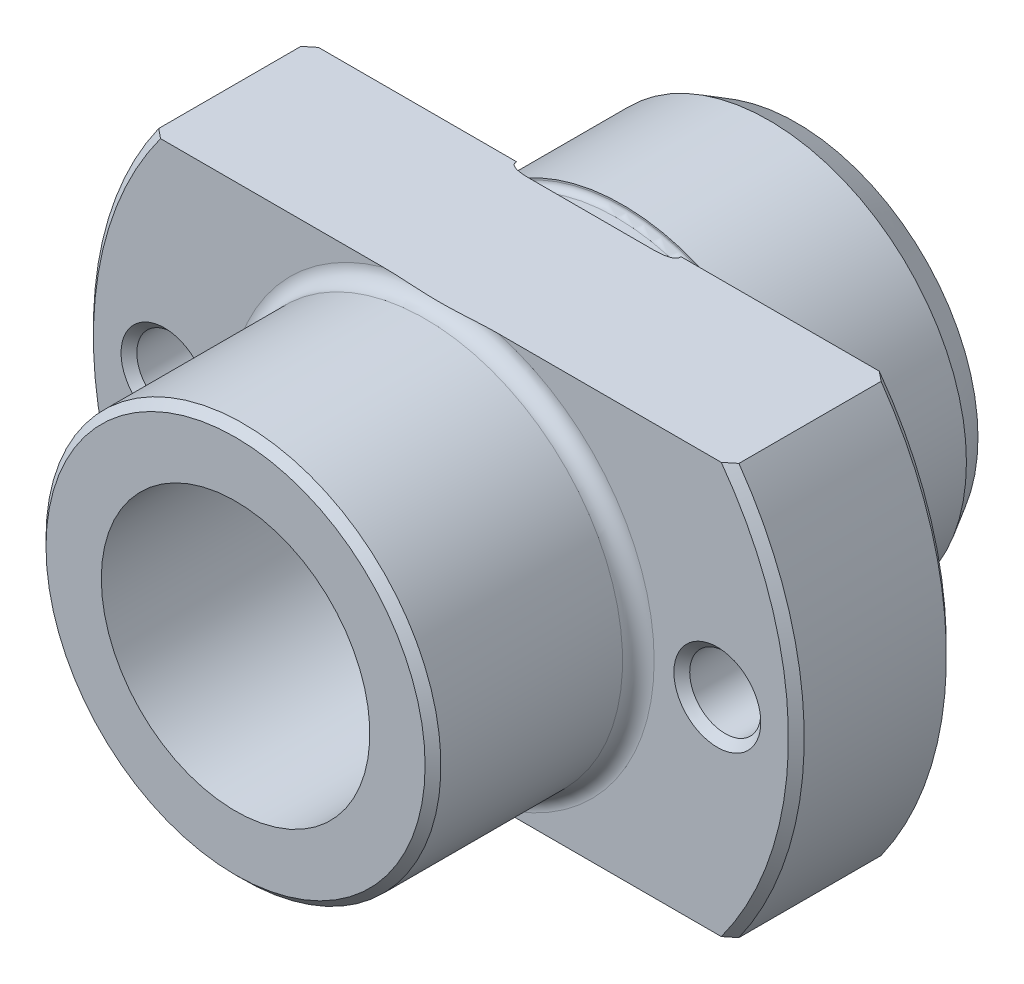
ISO-10303-21;
HEADER;
FILE_DESCRIPTION(('STEP AP214'),'2;1');
FILE_NAME('part.step','',(''),(''),'','','');
FILE_SCHEMA(('AUTOMOTIVE_DESIGN { 1 0 10303 214 1 1 1 1 }'));
ENDSEC;
DATA;
#1=APPLICATION_CONTEXT('core data for automotive mechanical design processes');
#2=APPLICATION_PROTOCOL_DEFINITION('international standard','automotive_design',2000,#1);
#3=PRODUCT_CONTEXT('',#1,'mechanical');
#4=PRODUCT('Part','Part','',(#3));
#5=PRODUCT_RELATED_PRODUCT_CATEGORY('part','',(#4));
#6=PRODUCT_DEFINITION_FORMATION('','',#4);
#7=PRODUCT_DEFINITION_CONTEXT('part definition',#1,'design');
#8=PRODUCT_DEFINITION('design','',#6,#7);
#9=PRODUCT_DEFINITION_SHAPE('','',#8);
#10=(LENGTH_UNIT() NAMED_UNIT(*) SI_UNIT(.MILLI.,.METRE.));
#11=(NAMED_UNIT(*) PLANE_ANGLE_UNIT() SI_UNIT($,.RADIAN.));
#12=(NAMED_UNIT(*) SI_UNIT($,.STERADIAN.) SOLID_ANGLE_UNIT());
#13=UNCERTAINTY_MEASURE_WITH_UNIT(LENGTH_MEASURE(1.E-05),#10,'distance_accuracy_value','');
#14=(GEOMETRIC_REPRESENTATION_CONTEXT(3) GLOBAL_UNCERTAINTY_ASSIGNED_CONTEXT((#13)) GLOBAL_UNIT_ASSIGNED_CONTEXT((#10,
#11,#12)) REPRESENTATION_CONTEXT('',''));
#15=CARTESIAN_POINT('',(0.,0.,0.));
#16=DIRECTION('',(0.,0.,1.));
#17=DIRECTION('',(1.,0.,0.));
#18=AXIS2_PLACEMENT_3D('',#15,#16,#17);
#19=CARTESIAN_POINT('',(12.5,0.,0.));
#20=DIRECTION('',(0.,0.,1.));
#21=DIRECTION('',(1.,0.,0.));
#22=AXIS2_PLACEMENT_3D('',#19,#20,#21);
#23=PLANE('',#22);
#24=CARTESIAN_POINT('',(-17.5,0.,0.));
#25=DIRECTION('',(0.,0.,1.));
#26=DIRECTION('',(1.,0.,0.));
#27=AXIS2_PLACEMENT_3D('',#24,#25,#26);
#28=CIRCLE('',#27,2.75000000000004);
#29=CARTESIAN_POINT('',(-14.75,0.,0.));
#30=VERTEX_POINT('',#29);
#31=EDGE_CURVE('E466',#30,#30,#28,.T.);
#32=ORIENTED_EDGE('',*,*,#31,.T.);
#33=EDGE_LOOP('',(#32));
#34=FACE_BOUND('',#33,.T.);
#35=DIRECTION('',(-1.,0.,0.));
#36=VECTOR('',#35,1.);
#37=CARTESIAN_POINT('',(12.5,-13.,0.));
#38=LINE('',#37,#36);
#39=CARTESIAN_POINT('',(-5.19615242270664,-13.,0.));
#40=VERTEX_POINT('',#39);
#41=CARTESIAN_POINT('',(-17.7482393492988,-13.,0.));
#42=VERTEX_POINT('',#41);
#43=EDGE_CURVE('E331',#40,#42,#38,.T.);
#44=ORIENTED_EDGE('',*,*,#43,.T.);
#45=CARTESIAN_POINT('',(0.,0.,0.));
#46=DIRECTION('',(0.,0.,1.));
#47=DIRECTION('',(1.,0.,0.));
#48=AXIS2_PLACEMENT_3D('',#45,#46,#47);
#49=CIRCLE('',#48,22.);
#50=CARTESIAN_POINT('',(-17.7482393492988,13.,0.));
#51=VERTEX_POINT('',#50);
#52=EDGE_CURVE('E272',#42,#51,#49,.F.);
#53=ORIENTED_EDGE('',*,*,#52,.T.);
#54=DIRECTION('',(1.,0.,0.));
#55=VECTOR('',#54,1.);
#56=CARTESIAN_POINT('',(12.5,13.,0.));
#57=LINE('',#56,#55);
#58=CARTESIAN_POINT('',(-5.19615242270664,13.,0.));
#59=VERTEX_POINT('',#58);
#60=EDGE_CURVE('E425',#51,#59,#57,.T.);
#61=ORIENTED_EDGE('',*,*,#60,.T.);
#62=CARTESIAN_POINT('',(0.,0.,0.));
#63=DIRECTION('',(0.,0.,1.));
#64=DIRECTION('',(1.,0.,0.));
#65=AXIS2_PLACEMENT_3D('',#62,#63,#64);
#66=CIRCLE('',#65,14.);
#67=EDGE_CURVE('E303',#40,#59,#66,.F.);
#68=ORIENTED_EDGE('',*,*,#67,.F.);
#69=EDGE_LOOP('',(#44,#53,#61,#68));
#70=FACE_BOUND('',#69,.T.);
#71=ADVANCED_FACE('F14',(#34,#70),#23,.F.);
#72=CARTESIAN_POINT('',(13.5,0.,10.));
#73=DIRECTION('',(0.,0.,-1.));
#74=DIRECTION('',(-1.,0.,0.));
#75=AXIS2_PLACEMENT_3D('',#72,#73,#74);
#76=PLANE('',#75);
#77=CARTESIAN_POINT('',(17.5,0.,10.));
#78=DIRECTION('',(0.,0.,-1.));
#79=DIRECTION('',(-1.,0.,0.));
#80=AXIS2_PLACEMENT_3D('',#77,#78,#79);
#81=CIRCLE('',#80,2.75000000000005);
#82=CARTESIAN_POINT('',(14.75,0.,10.));
#83=VERTEX_POINT('',#82);
#84=EDGE_CURVE('E453',#83,#83,#81,.T.);
#85=ORIENTED_EDGE('',*,*,#84,.T.);
#86=EDGE_LOOP('',(#85));
#87=FACE_BOUND('',#86,.T.);
#88=DIRECTION('',(1.,0.,0.));
#89=VECTOR('',#88,1.);
#90=CARTESIAN_POINT('',(13.5,-13.,10.));
#91=LINE('',#90,#89);
#92=CARTESIAN_POINT('',(3.64005494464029,-13.,10.));
#93=VERTEX_POINT('',#92);
#94=CARTESIAN_POINT('',(17.7482393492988,-13.,10.));
#95=VERTEX_POINT('',#94);
#96=EDGE_CURVE('E324',#93,#95,#91,.T.);
#97=ORIENTED_EDGE('',*,*,#96,.T.);
#98=CARTESIAN_POINT('',(0.,0.,10.));
#99=DIRECTION('',(0.,0.,-1.));
#100=DIRECTION('',(-1.,0.,0.));
#101=AXIS2_PLACEMENT_3D('',#98,#99,#100);
#102=CIRCLE('',#101,22.);
#103=CARTESIAN_POINT('',(17.7482393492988,13.,10.));
#104=VERTEX_POINT('',#103);
#105=EDGE_CURVE('E564',#95,#104,#102,.F.);
#106=ORIENTED_EDGE('',*,*,#105,.T.);
#107=DIRECTION('',(-1.,0.,0.));
#108=VECTOR('',#107,1.);
#109=CARTESIAN_POINT('',(13.5,13.,10.));
#110=LINE('',#109,#108);
#111=CARTESIAN_POINT('',(3.64005494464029,13.,10.));
#112=VERTEX_POINT('',#111);
#113=EDGE_CURVE('E357',#104,#112,#110,.T.);
#114=ORIENTED_EDGE('',*,*,#113,.T.);
#115=CARTESIAN_POINT('',(0.,0.,10.));
#116=DIRECTION('',(0.,0.,-1.));
#117=DIRECTION('',(-1.,0.,0.));
#118=AXIS2_PLACEMENT_3D('',#115,#116,#117);
#119=CIRCLE('',#118,13.5);
#120=EDGE_CURVE('E305',#112,#93,#119,.T.);
#121=ORIENTED_EDGE('',*,*,#120,.T.);
#122=EDGE_LOOP('',(#97,#106,#114,#121));
#123=FACE_BOUND('',#122,.T.);
#124=ADVANCED_FACE('F394',(#87,#123),#76,.F.);
#125=CARTESIAN_POINT('',(0.,0.,-20.2470119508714));
#126=DIRECTION('',(0.,0.,-1.));
#127=DIRECTION('',(-1.,0.,0.));
#128=AXIS2_PLACEMENT_3D('',#125,#126,#127);
#129=CYLINDRICAL_SURFACE('',#128,22.5);
#130=DIRECTION('',(0.,0.,1.));
#131=VECTOR('',#130,1.);
#132=CARTESIAN_POINT('',(-18.3643676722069,13.,-12.5));
#133=LINE('',#132,#131);
#134=CARTESIAN_POINT('',(-18.3643676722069,13.,0.500000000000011));
#135=VERTEX_POINT('',#134);
#136=CARTESIAN_POINT('',(-18.3643676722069,13.,9.5));
#137=VERTEX_POINT('',#136);
#138=EDGE_CURVE('E489',#135,#137,#133,.T.);
#139=ORIENTED_EDGE('',*,*,#138,.F.);
#140=CARTESIAN_POINT('',(0.,0.,0.500000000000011));
#141=DIRECTION('',(0.,0.,1.));
#142=DIRECTION('',(1.,0.,0.));
#143=AXIS2_PLACEMENT_3D('',#140,#141,#142);
#144=CIRCLE('',#143,22.5);
#145=CARTESIAN_POINT('',(-18.3643676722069,-13.,0.500000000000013));
#146=VERTEX_POINT('',#145);
#147=EDGE_CURVE('E277',#135,#146,#144,.T.);
#148=ORIENTED_EDGE('',*,*,#147,.T.);
#149=DIRECTION('',(0.,0.,1.));
#150=VECTOR('',#149,1.);
#151=CARTESIAN_POINT('',(-18.3643676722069,-13.,-12.5));
#152=LINE('',#151,#150);
#153=CARTESIAN_POINT('',(-18.3643676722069,-13.,9.5));
#154=VERTEX_POINT('',#153);
#155=EDGE_CURVE('E351',#146,#154,#152,.T.);
#156=ORIENTED_EDGE('',*,*,#155,.T.);
#157=CARTESIAN_POINT('',(0.,0.,9.5));
#158=DIRECTION('',(0.,0.,-1.));
#159=DIRECTION('',(-1.,0.,0.));
#160=AXIS2_PLACEMENT_3D('',#157,#158,#159);
#161=CIRCLE('',#160,22.5);
#162=EDGE_CURVE('E275',#154,#137,#161,.T.);
#163=ORIENTED_EDGE('',*,*,#162,.T.);
#164=EDGE_LOOP('',(#139,#148,#156,#163));
#165=FACE_BOUND('',#164,.T.);
#166=ADVANCED_FACE('F402',(#165),#129,.T.);
#167=CARTESIAN_POINT('',(0.,0.,0.));
#168=DIRECTION('',(0.,0.,-1.));
#169=DIRECTION('',(-1.,0.,0.));
#170=AXIS2_PLACEMENT_3D('',#167,#168,#169);
#171=CYLINDRICAL_SURFACE('',#170,14.);
#172=DIRECTION('',(0.,0.,-1.));
#173=VECTOR('',#172,1.);
#174=CARTESIAN_POINT('',(-5.19615242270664,13.,0.));
#175=LINE('',#174,#173);
#176=CARTESIAN_POINT('',(-5.19615242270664,13.,0.100000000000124));
#177=VERTEX_POINT('',#176);
#178=EDGE_CURVE('E423',#177,#59,#175,.T.);
#179=ORIENTED_EDGE('',*,*,#178,.F.);
#180=CARTESIAN_POINT('',(0.,0.,0.1));
#181=DIRECTION('',(0.,0.,-1.));
#182=DIRECTION('',(-1.,0.,0.));
#183=AXIS2_PLACEMENT_3D('',#180,#181,#182);
#184=CIRCLE('',#183,14.);
#185=CARTESIAN_POINT('',(-5.19615242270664,-13.,0.0999999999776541));
#186=VERTEX_POINT('',#185);
#187=EDGE_CURVE('E156',#177,#186,#184,.F.);
#188=ORIENTED_EDGE('',*,*,#187,.T.);
#189=DIRECTION('',(0.,0.,-1.));
#190=VECTOR('',#189,1.);
#191=CARTESIAN_POINT('',(-5.19615242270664,-13.,0.));
#192=LINE('',#191,#190);
#193=EDGE_CURVE('E336',#40,#186,#192,.F.);
#194=ORIENTED_EDGE('',*,*,#193,.F.);
#195=ORIENTED_EDGE('',*,*,#67,.T.);
#196=EDGE_LOOP('',(#179,#188,#194,#195));
#197=FACE_BOUND('',#196,.T.);
#198=ADVANCED_FACE('F415',(#197),#171,.F.);
#199=CARTESIAN_POINT('',(0.,0.,0.1));
#200=DIRECTION('',(0.,0.,-1.));
#201=DIRECTION('',(-1.,0.,0.));
#202=AXIS2_PLACEMENT_3D('',#199,#200,#201);
#203=TOROIDAL_SURFACE('',#202,13.6,0.4);
#204=ORIENTED_EDGE('',*,*,#187,.F.);
#205=CARTESIAN_POINT('',(-5.18349301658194,13.,0.0389026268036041));
#206=CARTESIAN_POINT('',(-5.18688752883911,13.,0.0470377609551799));
#207=CARTESIAN_POINT('',(-5.18968757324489,13.,0.0554239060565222));
#208=CARTESIAN_POINT('',(-5.1938593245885,13.,0.0725453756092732));
#209=CARTESIAN_POINT('',(-5.19523238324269,13.,0.0812803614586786));
#210=CARTESIAN_POINT('',(-5.19641018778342,13.,0.098889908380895));
#211=CARTESIAN_POINT('',(-5.19620929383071,13.,0.107764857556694));
#212=CARTESIAN_POINT('',(-5.19424906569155,13.,0.125340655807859));
#213=CARTESIAN_POINT('',(-5.19248876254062,13.,0.13404139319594));
#214=CARTESIAN_POINT('',(-5.18711674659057,13.,0.152664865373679));
#215=CARTESIAN_POINT('',(-5.18321526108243,13.,0.162502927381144));
#216=CARTESIAN_POINT('',(-5.17387272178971,13.,0.18141537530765));
#217=CARTESIAN_POINT('',(-5.16842871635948,13.,0.190488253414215));
#218=CARTESIAN_POINT('',(-5.15298012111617,13.,0.212774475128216));
#219=CARTESIAN_POINT('',(-5.14214352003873,13.,0.225404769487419));
#220=CARTESIAN_POINT('',(-5.11874570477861,13.,0.248933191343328));
#221=CARTESIAN_POINT('',(-5.10617994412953,13.,0.259826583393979));
#222=CARTESIAN_POINT('',(-5.06674205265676,13.,0.29048612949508));
#223=CARTESIAN_POINT('',(-5.03822876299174,13.,0.308113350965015));
#224=CARTESIAN_POINT('',(-4.97920205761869,13.,0.339524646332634));
#225=CARTESIAN_POINT('',(-4.94868285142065,13.,0.353296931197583));
#226=CARTESIAN_POINT('',(-4.86934264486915,13.,0.384907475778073));
#227=CARTESIAN_POINT('',(-4.81974364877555,13.,0.40077541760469));
#228=CARTESIAN_POINT('',(-4.71928800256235,13.,0.427977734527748));
#229=CARTESIAN_POINT('',(-4.66842880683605,13.,0.43930197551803));
#230=CARTESIAN_POINT('',(-4.56583367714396,13.,0.458552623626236));
#231=CARTESIAN_POINT('',(-4.51409474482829,13.,0.466462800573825));
#232=CARTESIAN_POINT('',(-4.41033435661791,13.,0.479510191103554));
#233=CARTESIAN_POINT('',(-4.35831323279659,13.,0.484650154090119));
#234=CARTESIAN_POINT('',(-4.24878777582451,13.,0.493037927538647));
#235=CARTESIAN_POINT('',(-4.19126495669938,13.,0.496039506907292));
#236=CARTESIAN_POINT('',(-4.07614037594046,13.,0.499666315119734));
#237=CARTESIAN_POINT('',(-4.01853860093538,13.,0.500291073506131));
#238=CARTESIAN_POINT('',(-3.84562407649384,13.,0.499044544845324));
#239=CARTESIAN_POINT('',(-3.7303291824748,13.,0.494044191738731));
#240=CARTESIAN_POINT('',(-3.50046301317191,13.,0.47700827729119));
#241=CARTESIAN_POINT('',(-3.38589088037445,13.,0.464983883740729));
#242=CARTESIAN_POINT('',(-3.21480906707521,13.,0.441721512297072));
#243=CARTESIAN_POINT('',(-3.15793532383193,13.,0.433101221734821));
#244=CARTESIAN_POINT('',(-3.04450927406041,13.,0.413971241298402));
#245=CARTESIAN_POINT('',(-2.98795691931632,13.,0.403461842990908));
#246=CARTESIAN_POINT('',(-2.8977859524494,13.,0.384866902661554));
#247=CARTESIAN_POINT('',(-2.86402109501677,13.,0.377487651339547));
#248=CARTESIAN_POINT('',(-2.79669799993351,13.,0.361796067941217));
#249=CARTESIAN_POINT('',(-2.76313981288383,13.,0.353483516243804));
#250=CARTESIAN_POINT('',(-2.69641400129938,13.,0.335740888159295));
#251=CARTESIAN_POINT('',(-2.66324557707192,13.,0.326313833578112));
#252=CARTESIAN_POINT('',(-2.59737035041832,13.,0.305978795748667));
#253=CARTESIAN_POINT('',(-2.56466331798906,13.,0.295071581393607));
#254=CARTESIAN_POINT('',(-2.51506676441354,13.,0.276643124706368));
#255=CARTESIAN_POINT('',(-2.49788793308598,13.,0.269902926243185));
#256=CARTESIAN_POINT('',(-2.46385264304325,13.,0.255581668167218));
#257=CARTESIAN_POINT('',(-2.44699657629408,13.,0.247999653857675));
#258=CARTESIAN_POINT('',(-2.41399889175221,13.,0.231748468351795));
#259=CARTESIAN_POINT('',(-2.39785232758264,13.,0.223089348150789));
#260=CARTESIAN_POINT('',(-2.36652601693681,13.,0.20404380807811));
#261=CARTESIAN_POINT('',(-2.35134609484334,13.,0.193657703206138));
#262=CARTESIAN_POINT('',(-2.33031621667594,13.,0.175831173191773));
#263=CARTESIAN_POINT('',(-2.32356488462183,13.,0.169474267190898));
#264=CARTESIAN_POINT('',(-2.31118053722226,13.,0.155759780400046));
#265=CARTESIAN_POINT('',(-2.30554028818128,13.,0.148409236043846));
#266=CARTESIAN_POINT('',(-2.29869663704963,13.,0.136672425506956));
#267=CARTESIAN_POINT('',(-2.29671525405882,13.,0.132745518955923));
#268=CARTESIAN_POINT('',(-2.29336140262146,13.,0.124636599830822));
#269=CARTESIAN_POINT('',(-2.29198840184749,13.,0.120454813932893));
#270=CARTESIAN_POINT('',(-2.28998605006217,13.,0.111867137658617));
#271=CARTESIAN_POINT('',(-2.28936421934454,13.,0.107459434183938));
#272=CARTESIAN_POINT('',(-2.2889776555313,13.,0.0986066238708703));
#273=CARTESIAN_POINT('',(-2.2892125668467,13.,0.0941615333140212));
#274=CARTESIAN_POINT('',(-2.29043548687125,13.,0.0858533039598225));
#275=CARTESIAN_POINT('',(-2.2913427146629,13.,0.0819776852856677));
#276=CARTESIAN_POINT('',(-2.29372287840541,13.,0.0744060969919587));
#277=CARTESIAN_POINT('',(-2.29519619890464,13.,0.0707102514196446));
#278=CARTESIAN_POINT('',(-2.29967200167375,13.,0.0612653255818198));
#279=CARTESIAN_POINT('',(-2.30305218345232,13.,0.0556967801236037));
#280=CARTESIAN_POINT('',(-2.31060852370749,13.,0.0451293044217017));
#281=CARTESIAN_POINT('',(-2.31478731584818,13.,0.0401323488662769));
#282=CARTESIAN_POINT('',(-2.33033446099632,13.,0.0234289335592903));
#283=CARTESIAN_POINT('',(-2.34303001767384,13.,0.0129861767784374));
#284=CARTESIAN_POINT('',(-2.36969818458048,13.,-0.00610828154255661));
#285=CARTESIAN_POINT('',(-2.38367870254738,13.,-0.0147476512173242));
#286=CARTESIAN_POINT('',(-2.42448521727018,13.,-0.0377195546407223));
#287=CARTESIAN_POINT('',(-2.4521065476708,13.,-0.0506308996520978));
#288=CARTESIAN_POINT('',(-2.50827872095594,13.,-0.0742826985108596));
#289=CARTESIAN_POINT('',(-2.53683195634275,13.,-0.0850169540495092));
#290=CARTESIAN_POINT('',(-2.59453272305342,13.,-0.105027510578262));
#291=CARTESIAN_POINT('',(-2.6236816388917,13.,-0.114299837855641));
#292=CARTESIAN_POINT('',(-2.68225770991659,13.,-0.131734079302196));
#293=CARTESIAN_POINT('',(-2.71168442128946,13.,-0.139897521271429));
#294=CARTESIAN_POINT('',(-2.80024717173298,13.,-0.163086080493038));
#295=CARTESIAN_POINT('',(-2.85971979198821,13.,-0.176826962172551));
#296=CARTESIAN_POINT('',(-2.97919477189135,13.,-0.201809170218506));
#297=CARTESIAN_POINT('',(-3.03919732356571,13.,-0.213049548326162));
#298=CARTESIAN_POINT('',(-3.15967235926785,13.,-0.233419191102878));
#299=CARTESIAN_POINT('',(-3.22014549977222,13.,-0.242544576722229));
#300=CARTESIAN_POINT('',(-3.3413587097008,13.,-0.258815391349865));
#301=CARTESIAN_POINT('',(-3.40209880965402,13.,-0.2659605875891));
#302=CARTESIAN_POINT('',(-3.58417066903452,13.,-0.284445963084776));
#303=CARTESIAN_POINT('',(-3.70581863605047,13.,-0.292913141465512));
#304=CARTESIAN_POINT('',(-3.88840291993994,13.,-0.299163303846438));
#305=CARTESIAN_POINT('',(-3.94924297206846,13.,-0.300173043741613));
#306=CARTESIAN_POINT('',(-4.07091244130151,13.,-0.29977772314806));
#307=CARTESIAN_POINT('',(-4.13174185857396,13.,-0.29837304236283));
#308=CARTESIAN_POINT('',(-4.25386935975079,13.,-0.292752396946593));
#309=CARTESIAN_POINT('',(-4.31516627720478,13.,-0.288509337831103));
#310=CARTESIAN_POINT('',(-4.43749978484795,13.,-0.276587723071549));
#311=CARTESIAN_POINT('',(-4.49853601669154,13.,-0.268905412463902));
#312=CARTESIAN_POINT('',(-4.62169055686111,13.,-0.248906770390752));
#313=CARTESIAN_POINT('',(-4.6837900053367,13.,-0.236464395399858));
#314=CARTESIAN_POINT('',(-4.77563082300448,13.,-0.21299947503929));
#315=CARTESIAN_POINT('',(-4.80598784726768,13.,-0.204391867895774));
#316=CARTESIAN_POINT('',(-4.86609383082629,13.,-0.185176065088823));
#317=CARTESIAN_POINT('',(-4.8958425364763,13.,-0.174567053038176));
#318=CARTESIAN_POINT('',(-4.94790715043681,13.,-0.153381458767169));
#319=CARTESIAN_POINT('',(-4.97042511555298,13.,-0.143305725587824));
#320=CARTESIAN_POINT('',(-5.01444979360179,13.,-0.121175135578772));
#321=CARTESIAN_POINT('',(-5.03595819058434,13.,-0.109123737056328));
#322=CARTESIAN_POINT('',(-5.07365755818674,13.,-0.0847728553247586));
#323=CARTESIAN_POINT('',(-5.09011653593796,13.,-0.0728935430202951));
#324=CARTESIAN_POINT('',(-5.12115419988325,13.,-0.0468721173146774));
#325=CARTESIAN_POINT('',(-5.13573896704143,13.,-0.0327376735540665));
#326=CARTESIAN_POINT('',(-5.15573154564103,13.,-0.00870862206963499));
#327=CARTESIAN_POINT('',(-5.16230433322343,13.,0.000207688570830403));
#328=CARTESIAN_POINT('',(-5.17405830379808,13.,0.0189199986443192));
#329=CARTESIAN_POINT('',(-5.17924184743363,13.,0.0287144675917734));
#330=CARTESIAN_POINT('',(-5.18349301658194,13.,0.0389026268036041));
#331=B_SPLINE_CURVE_WITH_KNOTS('',3,(#205,#206,#207,#208,#209,#210,#211,#212,#213,#214,#215,
#216,#217,#218,#219,#220,#221,#222,#223,#224,#225,#226,#227,#228,#229,#230,#231,#232,#233,#234,
#235,#236,#237,#238,#239,#240,#241,#242,#243,#244,#245,#246,#247,#248,#249,#250,#251,#252,#253,
#254,#255,#256,#257,#258,#259,#260,#261,#262,#263,#264,#265,#266,#267,#268,#269,#270,#271,#272,
#273,#274,#275,#276,#277,#278,#279,#280,#281,#282,#283,#284,#285,#286,#287,#288,#289,#290,#291,
#292,#293,#294,#295,#296,#297,#298,#299,#300,#301,#302,#303,#304,#305,#306,#307,#308,#309,#310,
#311,#312,#313,#314,#315,#316,#317,#318,#319,#320,#321,#322,#323,#324,#325,#326,#327,#328,#329,
#330),.UNSPECIFIED.,.T.,.F.,(4,2,2,2,2,2,2,2,2,2,2,2,2,2,2,2,2,2,2,2,2,2,2,2,2,2,2,2,2,2,2,2,2,
2,2,2,2,2,2,2,2,2,2,2,2,2,2,2,2,2,2,2,2,2,2,2,2,2,2,2,2,2,4),(0.,0.0264176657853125,
0.0528102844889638,0.0792975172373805,0.105801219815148,0.137375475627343,0.169010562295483,
0.218653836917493,0.26843022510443,0.368435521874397,0.468743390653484,0.624585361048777,
0.780773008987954,0.937695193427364,1.09446134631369,1.26720460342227,1.43998205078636,
1.78591793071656,2.13130528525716,2.30385160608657,2.47637131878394,2.5800469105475,
2.68374695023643,2.78717200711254,2.89054354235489,2.94589157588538,3.00130303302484,
3.05623155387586,3.11115006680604,3.13890806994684,3.16647890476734,3.17963550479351,
3.19278057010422,3.206056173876,3.21932626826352,3.23121762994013,3.24311708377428,
3.26254593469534,3.28203999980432,3.33097358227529,3.38023154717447,3.47145954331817,
3.562943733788,3.65467245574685,3.74627348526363,3.92930561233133,4.11240703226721,
4.29584166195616,4.47929784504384,4.84479941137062,5.02730999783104,5.20979188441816,
5.39404103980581,5.5784918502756,5.76820891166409,5.86282237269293,5.95747451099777,
6.03141563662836,6.1052286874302,6.16599807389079,6.22656502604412,6.25970626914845,
6.29279083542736),.UNSPECIFIED.);
#332=CARTESIAN_POINT('',(-3.99499687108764,13.,0.5));
#333=VERTEX_POINT('',#332);
#334=EDGE_CURVE('E137',#177,#333,#331,.T.);
#335=ORIENTED_EDGE('',*,*,#334,.T.);
#336=CARTESIAN_POINT('',(0.,0.,0.5));
#337=DIRECTION('',(0.,0.,-1.));
#338=DIRECTION('',(-1.,0.,0.));
#339=AXIS2_PLACEMENT_3D('',#336,#337,#338);
#340=CIRCLE('',#339,13.6);
#341=CARTESIAN_POINT('',(-3.99499687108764,-13.,0.5));
#342=VERTEX_POINT('',#341);
#343=EDGE_CURVE('E148',#342,#333,#340,.T.);
#344=ORIENTED_EDGE('',*,*,#343,.F.);
#345=CARTESIAN_POINT('',(-5.18349301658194,-13.,0.0389026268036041));
#346=CARTESIAN_POINT('',(-5.17798142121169,-13.,0.0256971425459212));
#347=CARTESIAN_POINT('',(-5.17089594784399,-13.,0.0131403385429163));
#348=CARTESIAN_POINT('',(-5.15458819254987,-13.,-0.0105218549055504));
#349=CARTESIAN_POINT('',(-5.14535329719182,-13.,-0.0216180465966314));
#350=CARTESIAN_POINT('',(-5.11955329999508,-13.,-0.048729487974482));
#351=CARTESIAN_POINT('',(-5.10191285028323,-13.,-0.0637055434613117));
#352=CARTESIAN_POINT('',(-5.06477594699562,-13.,-0.09103713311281));
#353=CARTESIAN_POINT('',(-5.04527711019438,-13.,-0.103389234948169));
#354=CARTESIAN_POINT('',(-4.9973270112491,-13.,-0.130560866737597));
#355=CARTESIAN_POINT('',(-4.96835766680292,-13.,-0.144455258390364));
#356=CARTESIAN_POINT('',(-4.9092352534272,-13.,-0.169495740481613));
#357=CARTESIAN_POINT('',(-4.87907990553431,-13.,-0.180636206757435));
#358=CARTESIAN_POINT('',(-4.81791079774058,-13.,-0.200837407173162));
#359=CARTESIAN_POINT('',(-4.78689331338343,-13.,-0.209886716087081));
#360=CARTESIAN_POINT('',(-4.72444245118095,-13.,-0.226246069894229));
#361=CARTESIAN_POINT('',(-4.69300947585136,-13.,-0.233557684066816));
#362=CARTESIAN_POINT('',(-4.61371335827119,-13.,-0.250120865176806));
#363=CARTESIAN_POINT('',(-4.56565927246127,-13.,-0.258455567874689));
#364=CARTESIAN_POINT('',(-4.46916771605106,-13.,-0.272534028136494));
#365=CARTESIAN_POINT('',(-4.42073008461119,-13.,-0.278276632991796));
#366=CARTESIAN_POINT('',(-4.27494646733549,-13.,-0.292311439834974));
#367=CARTESIAN_POINT('',(-4.17728831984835,-13.,-0.297381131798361));
#368=CARTESIAN_POINT('',(-3.98197064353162,-13.,-0.301042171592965));
#369=CARTESIAN_POINT('',(-3.88431115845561,-13.,-0.299637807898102));
#370=CARTESIAN_POINT('',(-3.68920564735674,-13.,-0.291399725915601));
#371=CARTESIAN_POINT('',(-3.59175968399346,-13.,-0.284564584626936));
#372=CARTESIAN_POINT('',(-3.38792146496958,-13.,-0.265044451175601));
#373=CARTESIAN_POINT('',(-3.28157656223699,-13.,-0.2518571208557));
#374=CARTESIAN_POINT('',(-3.12283860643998,-13.,-0.227405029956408));
#375=CARTESIAN_POINT('',(-3.07007855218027,-13.,-0.218480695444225));
#376=CARTESIAN_POINT('',(-2.9648921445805,-13.,-0.198881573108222));
#377=CARTESIAN_POINT('',(-2.91246573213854,-13.,-0.188207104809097));
#378=CARTESIAN_POINT('',(-2.80558470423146,-13.,-0.164206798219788));
#379=CARTESIAN_POINT('',(-2.75115226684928,-13.,-0.150778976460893));
#380=CARTESIAN_POINT('',(-2.67020497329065,-13.,-0.128228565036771));
#381=CARTESIAN_POINT('',(-2.64335354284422,-13.,-0.120315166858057));
#382=CARTESIAN_POINT('',(-2.58997914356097,-13.,-0.103455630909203));
#383=CARTESIAN_POINT('',(-2.56345607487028,-13.,-0.0945098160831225));
#384=CARTESIAN_POINT('',(-2.51954922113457,-13.,-0.0783680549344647));
#385=CARTESIAN_POINT('',(-2.50202276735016,-13.,-0.0715613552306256));
#386=CARTESIAN_POINT('',(-2.46729667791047,-13.,-0.0570968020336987));
#387=CARTESIAN_POINT('',(-2.45009736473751,-13.,-0.0494381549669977));
#388=CARTESIAN_POINT('',(-2.41649349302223,-13.,-0.0330511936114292));
#389=CARTESIAN_POINT('',(-2.40008148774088,-13.,-0.0243381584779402));
#390=CARTESIAN_POINT('',(-2.36821959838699,-13.,-0.00517029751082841));
#391=CARTESIAN_POINT('',(-2.35276965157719,-13.,0.00528441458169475));
#392=CARTESIAN_POINT('',(-2.33133432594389,-13.,0.0232406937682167));
#393=CARTESIAN_POINT('',(-2.3244471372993,-13.,0.0296455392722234));
#394=CARTESIAN_POINT('',(-2.31179574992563,-13.,0.0434732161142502));
#395=CARTESIAN_POINT('',(-2.30602424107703,-13.,0.0508888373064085));
#396=CARTESIAN_POINT('',(-2.29902856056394,-13.,0.0627053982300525));
#397=CARTESIAN_POINT('',(-2.29701219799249,-13.,0.0666313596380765));
#398=CARTESIAN_POINT('',(-2.29358463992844,-13.,0.0747424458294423));
#399=CARTESIAN_POINT('',(-2.29217293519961,-13.,0.0789273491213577));
#400=CARTESIAN_POINT('',(-2.29009153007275,-13.,0.0875290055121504));
#401=CARTESIAN_POINT('',(-2.28942952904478,-13.,0.0919476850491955));
#402=CARTESIAN_POINT('',(-2.2889677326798,-13.,0.100829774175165));
#403=CARTESIAN_POINT('',(-2.28916750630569,-13.,0.105293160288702));
#404=CARTESIAN_POINT('',(-2.29033187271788,-13.,0.113632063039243));
#405=CARTESIAN_POINT('',(-2.29121326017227,-13.,0.117519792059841));
#406=CARTESIAN_POINT('',(-2.2935480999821,-13.,0.125117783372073));
#407=CARTESIAN_POINT('',(-2.29500196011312,-13.,0.128827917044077));
#408=CARTESIAN_POINT('',(-2.2994055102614,-13.,0.138248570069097));
#409=CARTESIAN_POINT('',(-2.30272508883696,-13.,0.143784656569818));
#410=CARTESIAN_POINT('',(-2.31015758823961,-13.,0.154295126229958));
#411=CARTESIAN_POINT('',(-2.31427308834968,-13.,0.15926759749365));
#412=CARTESIAN_POINT('',(-2.32951281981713,-13.,0.175799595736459));
#413=CARTESIAN_POINT('',(-2.34194054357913,-13.,0.186130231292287));
#414=CARTESIAN_POINT('',(-2.36806554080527,-13.,0.205030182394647));
#415=CARTESIAN_POINT('',(-2.38177067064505,-13.,0.213587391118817));
#416=CARTESIAN_POINT('',(-2.42160953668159,-13.,0.23624502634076));
#417=CARTESIAN_POINT('',(-2.44852060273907,-13.,0.248970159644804));
#418=CARTESIAN_POINT('',(-2.50326346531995,-13.,0.272295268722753));
#419=CARTESIAN_POINT('',(-2.53109762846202,-13.,0.28288919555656));
#420=CARTESIAN_POINT('',(-2.58735314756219,-13.,0.302648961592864));
#421=CARTESIAN_POINT('',(-2.61577586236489,-13.,0.311810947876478));
#422=CARTESIAN_POINT('',(-2.67289851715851,-13.,0.32904754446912));
#423=CARTESIAN_POINT('',(-2.70159801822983,-13.,0.337123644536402));
#424=CARTESIAN_POINT('',(-2.7879386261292,-13.,0.360068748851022));
#425=CARTESIAN_POINT('',(-2.84591298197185,-13.,0.37368454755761));
#426=CARTESIAN_POINT('',(-2.96238107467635,-13.,0.398487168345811));
#427=CARTESIAN_POINT('',(-3.0208749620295,-13.,0.409673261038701));
#428=CARTESIAN_POINT('',(-3.13832349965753,-13.,0.430008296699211));
#429=CARTESIAN_POINT('',(-3.19727878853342,-13.,0.439153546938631));
#430=CARTESIAN_POINT('',(-3.31545801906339,-13.,0.455549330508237));
#431=CARTESIAN_POINT('',(-3.37468200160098,-13.,0.462799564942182));
#432=CARTESIAN_POINT('',(-3.55217806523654,-13.,0.48173273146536));
#433=CARTESIAN_POINT('',(-3.67075284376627,-13.,0.490679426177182));
#434=CARTESIAN_POINT('',(-3.9082246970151,-13.,0.500587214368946));
#435=CARTESIAN_POINT('',(-4.02712160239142,-13.,0.501551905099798));
#436=CARTESIAN_POINT('',(-4.20814941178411,-13.,0.495300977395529));
#437=CARTESIAN_POINT('',(-4.27040634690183,-13.,0.491754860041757));
#438=CARTESIAN_POINT('',(-4.3947006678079,-13.,0.481290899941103));
#439=CARTESIAN_POINT('',(-4.45673781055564,-13.,0.474370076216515));
#440=CARTESIAN_POINT('',(-4.58142287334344,-13.,0.456132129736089));
#441=CARTESIAN_POINT('',(-4.64405975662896,-13.,0.444733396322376));
#442=CARTESIAN_POINT('',(-4.73690456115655,-13.,0.423142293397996));
#443=CARTESIAN_POINT('',(-4.7676369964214,-13.,0.415206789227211));
#444=CARTESIAN_POINT('',(-4.82856261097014,-13.,0.39750009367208));
#445=CARTESIAN_POINT('',(-4.85875610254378,-13.,0.387730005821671));
#446=CARTESIAN_POINT('',(-4.91029136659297,-13.,0.368804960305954));
#447=CARTESIAN_POINT('',(-4.93183056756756,-13.,0.360190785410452));
#448=CARTESIAN_POINT('',(-4.9742836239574,-13.,0.341414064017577));
#449=CARTESIAN_POINT('',(-4.99519629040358,-13.,0.331248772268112));
#450=CARTESIAN_POINT('',(-5.03614165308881,-13.,0.308888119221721));
#451=CARTESIAN_POINT('',(-5.05616581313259,-13.,0.296676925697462));
#452=CARTESIAN_POINT('',(-5.09439882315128,-13.,0.269687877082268));
#453=CARTESIAN_POINT('',(-5.11261429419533,-13.,0.254919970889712));
#454=CARTESIAN_POINT('',(-5.1369023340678,-13.,0.230748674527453));
#455=CARTESIAN_POINT('',(-5.14428199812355,-13.,0.22266747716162));
#456=CARTESIAN_POINT('',(-5.15803003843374,-13.,0.205662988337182));
#457=CARTESIAN_POINT('',(-5.16439786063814,-13.,0.196739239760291));
#458=CARTESIAN_POINT('',(-5.17580677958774,-13.,0.177904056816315));
#459=CARTESIAN_POINT('',(-5.18082989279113,-13.,0.167981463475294));
#460=CARTESIAN_POINT('',(-5.18892894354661,-13.,0.147372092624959));
#461=CARTESIAN_POINT('',(-5.19201015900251,-13.,0.136687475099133));
#462=CARTESIAN_POINT('',(-5.1953683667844,-13.,0.117420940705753));
#463=CARTESIAN_POINT('',(-5.19612836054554,-13.,0.108922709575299));
#464=CARTESIAN_POINT('',(-5.19617528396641,-13.,0.0919219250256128));
#465=CARTESIAN_POINT('',(-5.19546276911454,-13.,0.0834193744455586));
#466=CARTESIAN_POINT('',(-5.19300715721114,-13.,0.0688359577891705));
#467=CARTESIAN_POINT('',(-5.191579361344,-13.,0.0626990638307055));
#468=CARTESIAN_POINT('',(-5.18803313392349,-13.,0.0506339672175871));
#469=CARTESIAN_POINT('',(-5.18591504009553,-13.,0.0447056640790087));
#470=CARTESIAN_POINT('',(-5.18349301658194,-13.,0.0389026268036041));
#471=B_SPLINE_CURVE_WITH_KNOTS('',3,(#345,#346,#347,#348,#349,#350,#351,#352,#353,#354,#355,
#356,#357,#358,#359,#360,#361,#362,#363,#364,#365,#366,#367,#368,#369,#370,#371,#372,#373,#374,
#375,#376,#377,#378,#379,#380,#381,#382,#383,#384,#385,#386,#387,#388,#389,#390,#391,#392,#393,
#394,#395,#396,#397,#398,#399,#400,#401,#402,#403,#404,#405,#406,#407,#408,#409,#410,#411,#412,
#413,#414,#415,#416,#417,#418,#419,#420,#421,#422,#423,#424,#425,#426,#427,#428,#429,#430,#431,
#432,#433,#434,#435,#436,#437,#438,#439,#440,#441,#442,#443,#444,#445,#446,#447,#448,#449,#450,
#451,#452,#453,#454,#455,#456,#457,#458,#459,#460,#461,#462,#463,#464,#465,#466,#467,#468,#469,
#470),.UNSPECIFIED.,.T.,.F.,(4,2,2,2,2,2,2,2,2,2,2,2,2,2,2,2,2,2,2,2,2,2,2,2,2,2,2,2,2,2,2,2,2,
2,2,2,2,2,2,2,2,2,2,2,2,2,2,2,2,2,2,2,2,2,2,2,2,2,2,2,2,2,4),(0.,0.0428973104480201,
0.0860530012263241,0.155081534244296,0.224199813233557,0.320357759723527,0.416710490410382,
0.513577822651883,0.61035734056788,0.756573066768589,0.902853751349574,1.1958970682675,
1.48874629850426,1.78167228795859,2.10296124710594,2.26346665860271,2.42394279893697,
2.59205407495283,2.67602036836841,2.75996046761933,2.8163523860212,2.87279727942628,
2.92850486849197,2.98420882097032,3.01236295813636,3.04032585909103,3.05352798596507,
3.06671897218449,3.08004423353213,3.09336283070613,3.10527147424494,3.11718861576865,
3.13644132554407,3.15575750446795,3.20386469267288,3.25229020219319,3.34135819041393,
3.43067551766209,3.52022918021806,3.60965869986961,3.78823038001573,3.96685559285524,
4.14580143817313,4.32477549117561,4.68126983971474,5.0376035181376,5.22460449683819,
5.41177095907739,5.60251982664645,5.69770052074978,5.79282414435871,5.86237428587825,
5.93204898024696,6.00229011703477,6.07226382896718,6.10503558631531,6.13782522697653,
6.17103365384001,6.20415142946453,6.22962756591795,6.25509409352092,6.27395416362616,
6.29280502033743),.UNSPECIFIED.);
#472=EDGE_CURVE('E138',#342,#186,#471,.T.);
#473=ORIENTED_EDGE('',*,*,#472,.T.);
#474=EDGE_LOOP('',(#204,#335,#344,#473));
#475=FACE_BOUND('',#474,.T.);
#476=ADVANCED_FACE('F407',(#475),#203,.F.);
#477=CARTESIAN_POINT('',(17.5,0.,0.));
#478=DIRECTION('',(0.,0.,1.));
#479=DIRECTION('',(1.,0.,0.));
#480=AXIS2_PLACEMENT_3D('',#477,#478,#479);
#481=CIRCLE('',#480,2.75000000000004);
#482=CARTESIAN_POINT('',(20.25,0.,0.));
#483=VERTEX_POINT('',#482);
#484=EDGE_CURVE('E419',#483,#483,#481,.T.);
#485=ORIENTED_EDGE('',*,*,#484,.T.);
#486=EDGE_LOOP('',(#485));
#487=FACE_BOUND('',#486,.T.);
#488=CARTESIAN_POINT('',(5.19615242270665,13.,0.));
#489=VERTEX_POINT('',#488);
#490=CARTESIAN_POINT('',(17.7482393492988,13.,0.));
#491=VERTEX_POINT('',#490);
#492=EDGE_CURVE('E421',#489,#491,#57,.T.);
#493=ORIENTED_EDGE('',*,*,#492,.T.);
#494=CARTESIAN_POINT('',(0.,0.,0.));
#495=DIRECTION('',(0.,0.,1.));
#496=DIRECTION('',(1.,0.,0.));
#497=AXIS2_PLACEMENT_3D('',#494,#495,#496);
#498=CIRCLE('',#497,22.);
#499=CARTESIAN_POINT('',(17.7482393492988,-13.,0.));
#500=VERTEX_POINT('',#499);
#501=EDGE_CURVE('E269',#491,#500,#498,.F.);
#502=ORIENTED_EDGE('',*,*,#501,.T.);
#503=CARTESIAN_POINT('',(5.19615242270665,-13.,0.));
#504=VERTEX_POINT('',#503);
#505=EDGE_CURVE('E338',#500,#504,#38,.T.);
#506=ORIENTED_EDGE('',*,*,#505,.T.);
#507=EDGE_CURVE('E308',#489,#504,#66,.F.);
#508=ORIENTED_EDGE('',*,*,#507,.F.);
#509=EDGE_LOOP('',(#493,#502,#506,#508));
#510=FACE_BOUND('',#509,.T.);
#511=ADVANCED_FACE('F397',(#487,#510),#23,.F.);
#512=CARTESIAN_POINT('',(0.,0.,-20.2470119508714));
#513=DIRECTION('',(0.,0.,-1.));
#514=DIRECTION('',(-1.,0.,0.));
#515=AXIS2_PLACEMENT_3D('',#512,#513,#514);
#516=CYLINDRICAL_SURFACE('',#515,12.5);
#517=CARTESIAN_POINT('',(0.,0.,-10.7679491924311));
#518=DIRECTION('',(0.,0.,1.));
#519=DIRECTION('',(1.,0.,0.));
#520=AXIS2_PLACEMENT_3D('',#517,#518,#519);
#521=CIRCLE('',#520,12.5);
#522=CARTESIAN_POINT('',(12.5,0.,-10.7679491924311));
#523=VERTEX_POINT('',#522);
#524=EDGE_CURVE('E447',#523,#523,#521,.T.);
#525=ORIENTED_EDGE('',*,*,#524,.T.);
#526=EDGE_LOOP('',(#525));
#527=FACE_BOUND('',#526,.T.);
#528=CARTESIAN_POINT('',(0.,0.,-1.5));
#529=DIRECTION('',(0.,0.,1.));
#530=DIRECTION('',(1.,0.,0.));
#531=AXIS2_PLACEMENT_3D('',#528,#529,#530);
#532=CIRCLE('',#531,12.5);
#533=CARTESIAN_POINT('',(12.5,0.,-1.5));
#534=VERTEX_POINT('',#533);
#535=EDGE_CURVE('E318',#534,#534,#532,.T.);
#536=ORIENTED_EDGE('',*,*,#535,.F.);
#537=EDGE_LOOP('',(#536));
#538=FACE_BOUND('',#537,.T.);
#539=ADVANCED_FACE('F297',(#527,#538),#516,.T.);
#540=CARTESIAN_POINT('',(5.2,0.,-11.));
#541=DIRECTION('',(0.,0.,-1.));
#542=DIRECTION('',(-1.,0.,0.));
#543=AXIS2_PLACEMENT_3D('',#540,#541,#542);
#544=PLANE('',#543);
#545=CARTESIAN_POINT('',(0.,0.,-11.));
#546=DIRECTION('',(0.,0.,-1.));
#547=DIRECTION('',(-1.,0.,0.));
#548=AXIS2_PLACEMENT_3D('',#545,#546,#547);
#549=CIRCLE('',#548,8.6);
#550=CARTESIAN_POINT('',(-8.6,0.,-11.));
#551=VERTEX_POINT('',#550);
#552=EDGE_CURVE('E281',#551,#551,#549,.F.);
#553=ORIENTED_EDGE('',*,*,#552,.T.);
#554=EDGE_LOOP('',(#553));
#555=FACE_BOUND('',#554,.T.);
#556=CARTESIAN_POINT('',(0.,0.,-11.));
#557=DIRECTION('',(0.,0.,-1.));
#558=DIRECTION('',(-1.,0.,0.));
#559=AXIS2_PLACEMENT_3D('',#556,#557,#558);
#560=CIRCLE('',#559,5.2);
#561=CARTESIAN_POINT('',(-5.2,0.,-11.));
#562=VERTEX_POINT('',#561);
#563=EDGE_CURVE('E300',#562,#562,#560,.T.);
#564=ORIENTED_EDGE('',*,*,#563,.T.);
#565=EDGE_LOOP('',(#564));
#566=FACE_BOUND('',#565,.T.);
#567=ADVANCED_FACE('F293',(#555,#566),#544,.F.);
#568=CARTESIAN_POINT('',(0.,0.,-20.2470119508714));
#569=DIRECTION('',(0.,0.,-1.));
#570=DIRECTION('',(-1.,0.,0.));
#571=AXIS2_PLACEMENT_3D('',#568,#569,#570);
#572=CYLINDRICAL_SURFACE('',#571,8.5);
#573=CARTESIAN_POINT('',(0.,0.,-5.));
#574=DIRECTION('',(0.,0.,1.));
#575=DIRECTION('',(1.,0.,0.));
#576=AXIS2_PLACEMENT_3D('',#573,#574,#575);
#577=CIRCLE('',#576,8.5);
#578=CARTESIAN_POINT('',(8.5,0.,-5.));
#579=VERTEX_POINT('',#578);
#580=EDGE_CURVE('E491',#579,#579,#577,.T.);
#581=ORIENTED_EDGE('',*,*,#580,.F.);
#582=EDGE_LOOP('',(#581));
#583=FACE_BOUND('',#582,.T.);
#584=CARTESIAN_POINT('',(0.,0.,23.));
#585=DIRECTION('',(0.,0.,-1.));
#586=DIRECTION('',(-1.,0.,0.));
#587=AXIS2_PLACEMENT_3D('',#584,#585,#586);
#588=CIRCLE('',#587,8.5);
#589=CARTESIAN_POINT('',(-8.5,0.,23.));
#590=VERTEX_POINT('',#589);
#591=EDGE_CURVE('E158',#590,#590,#588,.T.);
#592=ORIENTED_EDGE('',*,*,#591,.F.);
#593=EDGE_LOOP('',(#592));
#594=FACE_BOUND('',#593,.T.);
#595=ADVANCED_FACE('F296',(#583,#594),#572,.F.);
#596=CARTESIAN_POINT('',(8.5,0.,23.));
#597=DIRECTION('',(0.,0.,-1.));
#598=DIRECTION('',(-1.,0.,0.));
#599=AXIS2_PLACEMENT_3D('',#596,#597,#598);
#600=PLANE('',#599);
#601=CARTESIAN_POINT('',(0.,0.,23.));
#602=DIRECTION('',(0.,0.,-1.));
#603=DIRECTION('',(-1.,0.,0.));
#604=AXIS2_PLACEMENT_3D('',#601,#602,#603);
#605=CIRCLE('',#604,12.);
#606=CARTESIAN_POINT('',(-12.,0.,23.));
#607=VERTEX_POINT('',#606);
#608=EDGE_CURVE('E439',#607,#607,#605,.F.);
#609=ORIENTED_EDGE('',*,*,#608,.T.);
#610=EDGE_LOOP('',(#609));
#611=FACE_BOUND('',#610,.T.);
#612=ORIENTED_EDGE('',*,*,#591,.T.);
#613=EDGE_LOOP('',(#612));
#614=FACE_BOUND('',#613,.T.);
#615=ADVANCED_FACE('F380',(#611,#614),#600,.F.);
#616=CARTESIAN_POINT('',(0.,0.,-20.2470119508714));
#617=DIRECTION('',(0.,0.,-1.));
#618=DIRECTION('',(-1.,0.,0.));
#619=AXIS2_PLACEMENT_3D('',#616,#617,#618);
#620=CYLINDRICAL_SURFACE('',#619,12.5);
#621=CARTESIAN_POINT('',(0.,0.,22.5));
#622=DIRECTION('',(0.,0.,-1.));
#623=DIRECTION('',(-1.,0.,0.));
#624=AXIS2_PLACEMENT_3D('',#621,#622,#623);
#625=CIRCLE('',#624,12.5);
#626=CARTESIAN_POINT('',(-12.5,0.,22.5));
#627=VERTEX_POINT('',#626);
#628=EDGE_CURVE('E444',#627,#627,#625,.T.);
#629=ORIENTED_EDGE('',*,*,#628,.T.);
#630=EDGE_LOOP('',(#629));
#631=FACE_BOUND('',#630,.T.);
#632=CARTESIAN_POINT('',(0.,0.,11.));
#633=DIRECTION('',(0.,0.,-1.));
#634=DIRECTION('',(-1.,0.,0.));
#635=AXIS2_PLACEMENT_3D('',#632,#633,#634);
#636=CIRCLE('',#635,12.5);
#637=CARTESIAN_POINT('',(-12.5,0.,11.));
#638=VERTEX_POINT('',#637);
#639=EDGE_CURVE('E313',#638,#638,#636,.T.);
#640=ORIENTED_EDGE('',*,*,#639,.F.);
#641=EDGE_LOOP('',(#640));
#642=FACE_BOUND('',#641,.T.);
#643=ADVANCED_FACE('F374',(#631,#642),#620,.T.);
#644=CARTESIAN_POINT('',(0.,0.,11.));
#645=DIRECTION('',(0.,0.,-1.));
#646=DIRECTION('',(-1.,0.,0.));
#647=AXIS2_PLACEMENT_3D('',#644,#645,#646);
#648=TOROIDAL_SURFACE('',#647,13.5,1.);
#649=ORIENTED_EDGE('',*,*,#120,.F.);
#650=CARTESIAN_POINT('',(0.,13.,10.1339745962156));
#651=CARTESIAN_POINT('',(-0.166694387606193,13.,10.1339725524));
#652=CARTESIAN_POINT('',(-0.333389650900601,13.,10.1320980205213));
#653=CARTESIAN_POINT('',(-0.666708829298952,13.,10.1248915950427));
#654=CARTESIAN_POINT('',(-0.833332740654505,13.,10.119559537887));
#655=CARTESIAN_POINT('',(-1.16666410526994,13.,10.1062592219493));
#656=CARTESIAN_POINT('',(-1.33337143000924,13.,10.0982879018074));
#657=CARTESIAN_POINT('',(-1.66671890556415,13.,10.0809241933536));
#658=CARTESIAN_POINT('',(-1.83335905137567,13.,10.0715317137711));
#659=CARTESIAN_POINT('',(-2.19130330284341,13.,10.0513898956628));
#660=CARTESIAN_POINT('',(-2.38260766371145,13.,10.0406454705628));
#661=CARTESIAN_POINT('',(-2.76533581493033,13.,10.0216447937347));
#662=CARTESIAN_POINT('',(-2.95675959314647,13.,10.0133883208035));
#663=CARTESIAN_POINT('',(-3.33984405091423,13.,10.0020993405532));
#664=CARTESIAN_POINT('',(-3.53150478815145,13.,9.99906857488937));
#665=CARTESIAN_POINT('',(-3.91475965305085,13.,10.0014439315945));
#666=CARTESIAN_POINT('',(-4.10635376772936,13.,10.006845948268));
#667=CARTESIAN_POINT('',(-4.39379723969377,13.,10.024503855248));
#668=CARTESIAN_POINT('',(-4.48993312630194,13.,10.0320224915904));
#669=CARTESIAN_POINT('',(-4.68180694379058,13.,10.0510083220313));
#670=CARTESIAN_POINT('',(-4.7775449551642,13.,10.0624746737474));
#671=CARTESIAN_POINT('',(-4.96807252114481,13.,10.0902251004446));
#672=CARTESIAN_POINT('',(-5.06286393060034,13.,10.106496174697));
#673=CARTESIAN_POINT('',(-5.25119125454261,13.,10.1450592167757));
#674=CARTESIAN_POINT('',(-5.34472799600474,13.,10.1673469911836));
#675=CARTESIAN_POINT('',(-5.5037183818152,13.,10.2123246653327));
#676=CARTESIAN_POINT('',(-5.56969487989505,13.,10.2331508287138));
#677=CARTESIAN_POINT('',(-5.70003967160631,13.,10.2797635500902));
#678=CARTESIAN_POINT('',(-5.76440505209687,13.,10.3055584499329));
#679=CARTESIAN_POINT('',(-5.89083973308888,13.,10.3635462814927));
#680=CARTESIAN_POINT('',(-5.95288715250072,13.,10.3957876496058));
#681=CARTESIAN_POINT('',(-6.07208497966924,13.,10.4682975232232));
#682=CARTESIAN_POINT('',(-6.12925165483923,13.,10.5085377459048));
#683=CARTESIAN_POINT('',(-6.20786689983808,13.,10.5763095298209));
#684=CARTESIAN_POINT('',(-6.23269680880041,13.,10.5998989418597));
#685=CARTESIAN_POINT('',(-6.27938883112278,13.,10.6499343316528));
#686=CARTESIAN_POINT('',(-6.30124889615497,13.,10.6763822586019));
#687=CARTESIAN_POINT('',(-6.34106620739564,13.,10.7326397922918));
#688=CARTESIAN_POINT('',(-6.3589702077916,13.,10.7624879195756));
#689=CARTESIAN_POINT('',(-6.38887972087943,13.,10.8250043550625));
#690=CARTESIAN_POINT('',(-6.40090228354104,13.,10.8576641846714));
#691=CARTESIAN_POINT('',(-6.41530689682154,13.,10.9158613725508));
#692=CARTESIAN_POINT('',(-6.4194049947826,13.,10.9409749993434));
#693=CARTESIAN_POINT('',(-6.42325575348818,13.,10.9915342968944));
#694=CARTESIAN_POINT('',(-6.4230104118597,13.,11.0169798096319));
#695=CARTESIAN_POINT('',(-6.41819998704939,13.,11.0674136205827));
#696=CARTESIAN_POINT('',(-6.41364092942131,13.,11.0924025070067));
#697=CARTESIAN_POINT('',(-6.40061957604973,13.,11.1413365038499));
#698=CARTESIAN_POINT('',(-6.39215423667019,13.,11.165280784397));
#699=CARTESIAN_POINT('',(-6.36804340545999,13.,11.2206359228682));
#700=CARTESIAN_POINT('',(-6.35088920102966,13.,11.2513864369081));
#701=CARTESIAN_POINT('',(-6.31192481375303,13.,11.3097706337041));
#702=CARTESIAN_POINT('',(-6.29010385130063,13.,11.3373968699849));
#703=CARTESIAN_POINT('',(-6.22844663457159,13.,11.4060207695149));
#704=CARTESIAN_POINT('',(-6.1858894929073,13.,11.444550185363));
#705=CARTESIAN_POINT('',(-6.09567860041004,13.,11.5150200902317));
#706=CARTESIAN_POINT('',(-6.04801148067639,13.,11.5469426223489));
#707=CARTESIAN_POINT('',(-5.94942831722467,13.,11.6055256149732));
#708=CARTESIAN_POINT('',(-5.89850413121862,13.,11.6321721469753));
#709=CARTESIAN_POINT('',(-5.79458677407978,13.,11.6811273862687));
#710=CARTESIAN_POINT('',(-5.74159151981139,13.,11.7034315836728));
#711=CARTESIAN_POINT('',(-5.63416392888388,13.,11.7444656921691));
#712=CARTESIAN_POINT('',(-5.5797296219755,13.,11.763190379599));
#713=CARTESIAN_POINT('',(-5.46994777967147,13.,11.7975931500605));
#714=CARTESIAN_POINT('',(-5.41460068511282,13.,11.813272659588));
#715=CARTESIAN_POINT('',(-5.26920645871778,13.,11.8508512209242));
#716=CARTESIAN_POINT('',(-5.17862870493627,13.,11.8706934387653));
#717=CARTESIAN_POINT('',(-4.99645753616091,13.,11.9050889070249));
#718=CARTESIAN_POINT('',(-4.90486357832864,13.,11.9196391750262));
#719=CARTESIAN_POINT('',(-4.72093441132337,13.,11.9444660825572));
#720=CARTESIAN_POINT('',(-4.62859813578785,13.,11.9547346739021));
#721=CARTESIAN_POINT('',(-4.44359438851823,13.,11.971732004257));
#722=CARTESIAN_POINT('',(-4.35092685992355,13.,11.9784601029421));
#723=CARTESIAN_POINT('',(-4.07147640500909,13.,11.994354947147));
#724=CARTESIAN_POINT('',(-3.88444454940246,13.,11.9990881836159));
#725=CARTESIAN_POINT('',(-3.51060691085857,13.,12.0006681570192));
#726=CARTESIAN_POINT('',(-3.32380109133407,13.,11.9975229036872));
#727=CARTESIAN_POINT('',(-2.91972177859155,13.,11.9854032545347));
#728=CARTESIAN_POINT('',(-2.70247761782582,13.,11.975557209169));
#729=CARTESIAN_POINT('',(-2.26811391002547,13.,11.9531775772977));
#730=CARTESIAN_POINT('',(-2.05099438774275,13.,11.940643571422));
#731=CARTESIAN_POINT('',(-1.61673511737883,13.,11.9163913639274));
#732=CARTESIAN_POINT('',(-1.39959537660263,13.,11.904673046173));
#733=CARTESIAN_POINT('',(-0.965157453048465,13.,11.8850528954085));
#734=CARTESIAN_POINT('',(-0.74785929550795,13.,11.8771505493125));
#735=CARTESIAN_POINT('',(-0.314315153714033,13.,11.8672417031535));
#736=CARTESIAN_POINT('',(-0.0980699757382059,13.,11.8652029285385));
#737=CARTESIAN_POINT('',(0.334392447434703,13.,11.8674675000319));
#738=CARTESIAN_POINT('',(0.550609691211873,13.,11.8717710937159));
#739=CARTESIAN_POINT('',(0.982967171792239,13.,11.8855949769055));
#740=CARTESIAN_POINT('',(1.19910732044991,13.,11.8951177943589));
#741=CARTESIAN_POINT('',(1.63124146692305,13.,11.9169555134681));
#742=CARTESIAN_POINT('',(1.84723545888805,13.,11.9292705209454));
#743=CARTESIAN_POINT('',(2.27937593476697,13.,11.953539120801));
#744=CARTESIAN_POINT('',(2.49552243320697,13.,11.96549249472));
#745=CARTESIAN_POINT('',(2.92807568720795,13.,11.9854300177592));
#746=CARTESIAN_POINT('',(3.14448249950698,13.,11.9934130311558));
#747=CARTESIAN_POINT('',(3.57898157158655,13.,12.0013427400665));
#748=CARTESIAN_POINT('',(3.79707538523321,13.,12.0012350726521));
#749=CARTESIAN_POINT('',(4.12380939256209,13.,11.9909541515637));
#750=CARTESIAN_POINT('',(4.23260001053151,13.,11.9858455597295));
#751=CARTESIAN_POINT('',(4.44988891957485,13.,11.9713817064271));
#752=CARTESIAN_POINT('',(4.55838726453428,13.,11.9620272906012));
#753=CARTESIAN_POINT('',(4.77672979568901,13.,11.937785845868));
#754=CARTESIAN_POINT('',(4.8865639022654,13.,11.922804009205));
#755=CARTESIAN_POINT('',(5.10524845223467,13.,11.8857755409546));
#756=CARTESIAN_POINT('',(5.2140969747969,13.,11.8637172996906));
#757=CARTESIAN_POINT('',(5.42831022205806,13.,11.8106875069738));
#758=CARTESIAN_POINT('',(5.53370136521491,13.,11.7798293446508));
#759=CARTESIAN_POINT('',(5.68834290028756,13.,11.7243637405));
#760=CARTESIAN_POINT('',(5.73924804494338,13.,11.7043793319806));
#761=CARTESIAN_POINT('',(5.83944443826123,13.,11.660739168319));
#762=CARTESIAN_POINT('',(5.88873685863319,13.,11.6370861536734));
#763=CARTESIAN_POINT('',(5.98017885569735,13.,11.5878968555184));
#764=CARTESIAN_POINT('',(6.02255171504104,13.,11.5627806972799));
#765=CARTESIAN_POINT('',(6.10457299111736,13.,11.5080986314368));
#766=CARTESIAN_POINT('',(6.14421274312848,13.,11.4785194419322));
#767=CARTESIAN_POINT('',(6.21965133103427,13.,11.4135770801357));
#768=CARTESIAN_POINT('',(6.25537899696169,13.,11.3781293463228));
#769=CARTESIAN_POINT('',(6.31927828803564,13.,11.3009862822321));
#770=CARTESIAN_POINT('',(6.34749367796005,13.,11.2593294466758));
#771=CARTESIAN_POINT('',(6.38174496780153,13.,11.1907801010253));
#772=CARTESIAN_POINT('',(6.39199863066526,13.,11.1659986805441));
#773=CARTESIAN_POINT('',(6.40835272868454,13.,11.1150933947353));
#774=CARTESIAN_POINT('',(6.41445728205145,13.,11.0889708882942));
#775=CARTESIAN_POINT('',(6.42196383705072,13.,11.0358980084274));
#776=CARTESIAN_POINT('',(6.4233400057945,13.,11.0089438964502));
#777=CARTESIAN_POINT('',(6.42116816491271,13.,10.955232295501));
#778=CARTESIAN_POINT('',(6.41761900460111,13.,10.9284748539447));
#779=CARTESIAN_POINT('',(6.40634418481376,13.,10.877687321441));
#780=CARTESIAN_POINT('',(6.39890191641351,13.,10.85359251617));
#781=CARTESIAN_POINT('',(6.38060521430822,13.,10.8067521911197));
#782=CARTESIAN_POINT('',(6.36974942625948,13.,10.7840072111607));
#783=CARTESIAN_POINT('',(6.33815575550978,13.,10.727352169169));
#784=CARTESIAN_POINT('',(6.3153360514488,13.,10.6946059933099));
#785=CARTESIAN_POINT('',(6.26489751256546,13.,10.6330430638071));
#786=CARTESIAN_POINT('',(6.23726440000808,13.,10.6042384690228));
#787=CARTESIAN_POINT('',(6.15733699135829,13.,10.5303910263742));
#788=CARTESIAN_POINT('',(6.10179717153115,13.,10.4888959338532));
#789=CARTESIAN_POINT('',(5.98550505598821,13.,10.4141578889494));
#790=CARTESIAN_POINT('',(5.92473990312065,13.,10.3809361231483));
#791=CARTESIAN_POINT('',(5.7961198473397,13.,10.3189723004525));
#792=CARTESIAN_POINT('',(5.72806074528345,13.,10.2906607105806));
#793=CARTESIAN_POINT('',(5.58981295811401,13.,10.239728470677));
#794=CARTESIAN_POINT('',(5.5196219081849,13.,10.2171144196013));
#795=CARTESIAN_POINT('',(5.37780195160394,13.,10.1764559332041));
#796=CARTESIAN_POINT('',(5.30617053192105,13.,10.1584203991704));
#797=CARTESIAN_POINT('',(5.16211590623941,13.,10.1261728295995));
#798=CARTESIAN_POINT('',(5.08969322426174,13.,10.1119584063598));
#799=CARTESIAN_POINT('',(4.87938061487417,13.,10.0754171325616));
#800=CARTESIAN_POINT('',(4.74078150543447,13.,10.0571810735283));
#801=CARTESIAN_POINT('',(4.46271412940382,13.,10.0290291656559));
#802=CARTESIAN_POINT('',(4.32324529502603,13.,10.0191194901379));
#803=CARTESIAN_POINT('',(4.04369180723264,13.,10.0055410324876));
#804=CARTESIAN_POINT('',(3.90360647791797,13.,10.0018871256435));
#805=CARTESIAN_POINT('',(3.6233826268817,13.,9.99925601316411));
#806=CARTESIAN_POINT('',(3.4832441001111,13.,10.0002796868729));
#807=CARTESIAN_POINT('',(3.06175364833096,13.,10.0083729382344));
#808=CARTESIAN_POINT('',(2.78051897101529,13.,10.0204986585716));
#809=CARTESIAN_POINT('',(2.21870140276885,13.,10.0492957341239));
#810=CARTESIAN_POINT('',(1.9381181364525,13.,10.0659613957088));
#811=CARTESIAN_POINT('',(1.51928917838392,13.,10.0887290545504));
#812=CARTESIAN_POINT('',(1.38110946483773,13.,10.0958981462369));
#813=CARTESIAN_POINT('',(1.10465248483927,13.,10.1088141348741));
#814=CARTESIAN_POINT('',(0.966375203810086,13.,10.1145607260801));
#815=CARTESIAN_POINT('',(0.690103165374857,13.,10.124005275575));
#816=CARTESIAN_POINT('',(0.552108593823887,13.,10.1277084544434));
#817=CARTESIAN_POINT('',(0.276076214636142,13.,10.1326939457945));
#818=CARTESIAN_POINT('',(0.138038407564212,13.,10.1339762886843));
#819=CARTESIAN_POINT('',(0.,13.,10.1339745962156));
#820=B_SPLINE_CURVE_WITH_KNOTS('',3,(#650,#651,#652,#653,#654,#655,#656,#657,#658,#659,#660,
#661,#662,#663,#664,#665,#666,#667,#668,#669,#670,#671,#672,#673,#674,#675,#676,#677,#678,#679,
#680,#681,#682,#683,#684,#685,#686,#687,#688,#689,#690,#691,#692,#693,#694,#695,#696,#697,#698,
#699,#700,#701,#702,#703,#704,#705,#706,#707,#708,#709,#710,#711,#712,#713,#714,#715,#716,#717,
#718,#719,#720,#721,#722,#723,#724,#725,#726,#727,#728,#729,#730,#731,#732,#733,#734,#735,#736,
#737,#738,#739,#740,#741,#742,#743,#744,#745,#746,#747,#748,#749,#750,#751,#752,#753,#754,#755,
#756,#757,#758,#759,#760,#761,#762,#763,#764,#765,#766,#767,#768,#769,#770,#771,#772,#773,#774,
#775,#776,#777,#778,#779,#780,#781,#782,#783,#784,#785,#786,#787,#788,#789,#790,#791,#792,#793,
#794,#795,#796,#797,#798,#799,#800,#801,#802,#803,#804,#805,#806,#807,#808,#809,#810,#811,#812,
#813,#814,#815,#816,#817,#818,#819),.UNSPECIFIED.,.T.,.F.,(4,2,2,2,2,2,2,2,2,2,2,2,2,2,2,2,2,2,
2,2,2,2,2,2,2,2,2,2,2,2,2,2,2,2,2,2,2,2,2,2,2,2,2,2,2,2,2,2,2,2,2,2,2,2,2,2,2,2,2,2,2,2,2,2,2,2,
2,2,2,2,2,2,2,2,2,2,2,2,2,2,2,2,2,2,4),(0.,0.500075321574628,1.00017430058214,1.50085540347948,
2.00156867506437,2.57638598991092,3.15115218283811,3.72610990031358,4.30078777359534,
4.59001380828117,4.87917816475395,5.16756715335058,5.45575566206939,5.66316688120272,
5.87092939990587,6.08031597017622,6.28897494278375,6.39153453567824,6.49416450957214,
6.59810143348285,6.70173523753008,6.77772751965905,6.85368485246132,6.92953624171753,
7.00544683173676,7.11048470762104,7.21576787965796,7.38702129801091,7.55873422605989,
7.73089459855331,7.90323283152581,8.07582067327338,8.24832747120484,8.52628235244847,
8.80439364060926,9.08302535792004,9.36170745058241,9.92268683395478,10.4830961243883,
11.1354434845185,11.7878926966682,12.4402488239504,13.0925172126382,13.7411884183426,
14.3898849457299,15.038895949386,15.6879315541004,16.3373517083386,16.9869575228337,
17.6409285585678,17.9675957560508,18.2941979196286,18.6265690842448,18.9594883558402,
19.2882979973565,19.4522512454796,19.6160826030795,19.7636483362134,19.9116622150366,
20.0620317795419,20.2115051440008,20.291665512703,20.3717462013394,20.4522637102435,
20.5328000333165,20.608154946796,20.6835397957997,20.8025894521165,20.9219984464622,
21.1288146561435,21.3361551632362,21.5569474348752,21.7779942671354,21.9994676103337,
22.220802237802,22.63978755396,23.0590832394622,23.4793745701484,23.8997449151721,
24.7440586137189,25.587318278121,26.0024087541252,26.4175883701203,26.8317023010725,
27.2458110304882),.UNSPECIFIED.);
#821=CARTESIAN_POINT('',(-3.6400549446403,13.,10.));
#822=VERTEX_POINT('',#821);
#823=EDGE_CURVE('E360',#112,#822,#820,.T.);
#824=ORIENTED_EDGE('',*,*,#823,.T.);
#825=CARTESIAN_POINT('',(-3.6400549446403,-13.,10.));
#826=VERTEX_POINT('',#825);
#827=EDGE_CURVE('E310',#826,#822,#119,.T.);
#828=ORIENTED_EDGE('',*,*,#827,.F.);
#829=CARTESIAN_POINT('',(0.,-13.,10.1339745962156));
#830=CARTESIAN_POINT('',(0.166694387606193,-13.,10.1339725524));
#831=CARTESIAN_POINT('',(0.333389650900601,-13.,10.1320980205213));
#832=CARTESIAN_POINT('',(0.666708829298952,-13.,10.1248915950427));
#833=CARTESIAN_POINT('',(0.833332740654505,-13.,10.119559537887));
#834=CARTESIAN_POINT('',(1.16666410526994,-13.,10.1062592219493));
#835=CARTESIAN_POINT('',(1.33337143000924,-13.,10.0982879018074));
#836=CARTESIAN_POINT('',(1.66671890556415,-13.,10.0809241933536));
#837=CARTESIAN_POINT('',(1.83335905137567,-13.,10.0715317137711));
#838=CARTESIAN_POINT('',(2.19130330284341,-13.,10.0513898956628));
#839=CARTESIAN_POINT('',(2.38260766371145,-13.,10.0406454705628));
#840=CARTESIAN_POINT('',(2.76533581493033,-13.,10.0216447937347));
#841=CARTESIAN_POINT('',(2.95675959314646,-13.,10.0133883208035));
#842=CARTESIAN_POINT('',(3.33984405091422,-13.,10.0020993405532));
#843=CARTESIAN_POINT('',(3.53150478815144,-13.,9.99906857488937));
#844=CARTESIAN_POINT('',(3.91475965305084,-13.,10.0014439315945));
#845=CARTESIAN_POINT('',(4.10635376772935,-13.,10.006845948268));
#846=CARTESIAN_POINT('',(4.39379723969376,-13.,10.024503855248));
#847=CARTESIAN_POINT('',(4.48993312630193,-13.,10.0320224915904));
#848=CARTESIAN_POINT('',(4.68180694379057,-13.,10.0510083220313));
#849=CARTESIAN_POINT('',(4.7775449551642,-13.,10.0624746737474));
#850=CARTESIAN_POINT('',(4.96807252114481,-13.,10.0902251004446));
#851=CARTESIAN_POINT('',(5.06286393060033,-13.,10.106496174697));
#852=CARTESIAN_POINT('',(5.25119125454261,-13.,10.1450592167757));
#853=CARTESIAN_POINT('',(5.34472799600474,-13.,10.1673469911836));
#854=CARTESIAN_POINT('',(5.5037183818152,-13.,10.2123246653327));
#855=CARTESIAN_POINT('',(5.56969487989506,-13.,10.2331508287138));
#856=CARTESIAN_POINT('',(5.70003967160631,-13.,10.2797635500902));
#857=CARTESIAN_POINT('',(5.76440505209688,-13.,10.3055584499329));
#858=CARTESIAN_POINT('',(5.89083973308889,-13.,10.3635462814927));
#859=CARTESIAN_POINT('',(5.95288715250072,-13.,10.3957876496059));
#860=CARTESIAN_POINT('',(6.07208497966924,-13.,10.4682975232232));
#861=CARTESIAN_POINT('',(6.12925165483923,-13.,10.5085377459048));
#862=CARTESIAN_POINT('',(6.20786689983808,-13.,10.5763095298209));
#863=CARTESIAN_POINT('',(6.2326968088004,-13.,10.5998989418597));
#864=CARTESIAN_POINT('',(6.27938883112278,-13.,10.6499343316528));
#865=CARTESIAN_POINT('',(6.30124889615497,-13.,10.6763822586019));
#866=CARTESIAN_POINT('',(6.34106620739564,-13.,10.7326397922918));
#867=CARTESIAN_POINT('',(6.3589702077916,-13.,10.7624879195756));
#868=CARTESIAN_POINT('',(6.38887972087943,-13.,10.8250043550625));
#869=CARTESIAN_POINT('',(6.40090228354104,-13.,10.8576641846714));
#870=CARTESIAN_POINT('',(6.41530689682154,-13.,10.9158613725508));
#871=CARTESIAN_POINT('',(6.4194049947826,-13.,10.9409749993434));
#872=CARTESIAN_POINT('',(6.42325575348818,-13.,10.9915342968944));
#873=CARTESIAN_POINT('',(6.4230104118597,-13.,11.0169798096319));
#874=CARTESIAN_POINT('',(6.41819998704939,-13.,11.0674136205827));
#875=CARTESIAN_POINT('',(6.41364092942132,-13.,11.0924025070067));
#876=CARTESIAN_POINT('',(6.40061957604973,-13.,11.1413365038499));
#877=CARTESIAN_POINT('',(6.39215423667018,-13.,11.165280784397));
#878=CARTESIAN_POINT('',(6.36804340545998,-13.,11.2206359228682));
#879=CARTESIAN_POINT('',(6.35088920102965,-13.,11.2513864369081));
#880=CARTESIAN_POINT('',(6.31192481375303,-13.,11.3097706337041));
#881=CARTESIAN_POINT('',(6.29010385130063,-13.,11.3373968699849));
#882=CARTESIAN_POINT('',(6.22844663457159,-13.,11.4060207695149));
#883=CARTESIAN_POINT('',(6.1858894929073,-13.,11.444550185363));
#884=CARTESIAN_POINT('',(6.09567860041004,-13.,11.5150200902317));
#885=CARTESIAN_POINT('',(6.04801148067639,-13.,11.5469426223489));
#886=CARTESIAN_POINT('',(5.94942831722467,-13.,11.6055256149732));
#887=CARTESIAN_POINT('',(5.89850413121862,-13.,11.6321721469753));
#888=CARTESIAN_POINT('',(5.79458677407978,-13.,11.6811273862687));
#889=CARTESIAN_POINT('',(5.74159151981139,-13.,11.7034315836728));
#890=CARTESIAN_POINT('',(5.63416392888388,-13.,11.7444656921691));
#891=CARTESIAN_POINT('',(5.5797296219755,-13.,11.763190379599));
#892=CARTESIAN_POINT('',(5.46994777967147,-13.,11.7975931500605));
#893=CARTESIAN_POINT('',(5.41460068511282,-13.,11.813272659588));
#894=CARTESIAN_POINT('',(5.26920645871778,-13.,11.8508512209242));
#895=CARTESIAN_POINT('',(5.17862870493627,-13.,11.8706934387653));
#896=CARTESIAN_POINT('',(4.99645753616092,-13.,11.9050889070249));
#897=CARTESIAN_POINT('',(4.90486357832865,-13.,11.9196391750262));
#898=CARTESIAN_POINT('',(4.72093441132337,-13.,11.9444660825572));
#899=CARTESIAN_POINT('',(4.62859813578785,-13.,11.9547346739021));
#900=CARTESIAN_POINT('',(4.44359438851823,-13.,11.971732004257));
#901=CARTESIAN_POINT('',(4.35092685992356,-13.,11.9784601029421));
#902=CARTESIAN_POINT('',(4.0714764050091,-13.,11.994354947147));
#903=CARTESIAN_POINT('',(3.88444454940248,-13.,11.9990881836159));
#904=CARTESIAN_POINT('',(3.51060691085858,-13.,12.0006681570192));
#905=CARTESIAN_POINT('',(3.32380109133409,-13.,11.9975229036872));
#906=CARTESIAN_POINT('',(2.91972177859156,-13.,11.9854032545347));
#907=CARTESIAN_POINT('',(2.70247761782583,-13.,11.975557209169));
#908=CARTESIAN_POINT('',(2.26811391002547,-13.,11.9531775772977));
#909=CARTESIAN_POINT('',(2.05099438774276,-13.,11.940643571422));
#910=CARTESIAN_POINT('',(1.61673511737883,-13.,11.9163913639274));
#911=CARTESIAN_POINT('',(1.39959537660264,-13.,11.904673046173));
#912=CARTESIAN_POINT('',(0.965157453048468,-13.,11.8850528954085));
#913=CARTESIAN_POINT('',(0.747859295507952,-13.,11.8771505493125));
#914=CARTESIAN_POINT('',(0.314315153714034,-13.,11.8672417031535));
#915=CARTESIAN_POINT('',(0.0980699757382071,-13.,11.8652029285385));
#916=CARTESIAN_POINT('',(-0.334392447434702,-13.,11.8674675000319));
#917=CARTESIAN_POINT('',(-0.550609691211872,-13.,11.8717710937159));
#918=CARTESIAN_POINT('',(-0.982967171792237,-13.,11.8855949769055));
#919=CARTESIAN_POINT('',(-1.19910732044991,-13.,11.8951177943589));
#920=CARTESIAN_POINT('',(-1.63124146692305,-13.,11.9169555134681));
#921=CARTESIAN_POINT('',(-1.84723545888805,-13.,11.9292705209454));
#922=CARTESIAN_POINT('',(-2.27937593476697,-13.,11.953539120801));
#923=CARTESIAN_POINT('',(-2.49552243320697,-13.,11.96549249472));
#924=CARTESIAN_POINT('',(-2.92807568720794,-13.,11.9854300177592));
#925=CARTESIAN_POINT('',(-3.14448249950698,-13.,11.9934130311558));
#926=CARTESIAN_POINT('',(-3.57898157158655,-13.,12.0013427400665));
#927=CARTESIAN_POINT('',(-3.79707538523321,-13.,12.0012350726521));
#928=CARTESIAN_POINT('',(-4.12380939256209,-13.,11.9909541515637));
#929=CARTESIAN_POINT('',(-4.23260001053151,-13.,11.9858455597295));
#930=CARTESIAN_POINT('',(-4.44988891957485,-13.,11.9713817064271));
#931=CARTESIAN_POINT('',(-4.55838726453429,-13.,11.9620272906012));
#932=CARTESIAN_POINT('',(-4.77672979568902,-13.,11.937785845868));
#933=CARTESIAN_POINT('',(-4.88656390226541,-13.,11.922804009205));
#934=CARTESIAN_POINT('',(-5.10524845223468,-13.,11.8857755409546));
#935=CARTESIAN_POINT('',(-5.21409697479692,-13.,11.8637172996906));
#936=CARTESIAN_POINT('',(-5.42831022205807,-13.,11.8106875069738));
#937=CARTESIAN_POINT('',(-5.53370136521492,-13.,11.7798293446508));
#938=CARTESIAN_POINT('',(-5.68834290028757,-13.,11.7243637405));
#939=CARTESIAN_POINT('',(-5.73924804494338,-13.,11.7043793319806));
#940=CARTESIAN_POINT('',(-5.83944443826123,-13.,11.660739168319));
#941=CARTESIAN_POINT('',(-5.88873685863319,-13.,11.6370861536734));
#942=CARTESIAN_POINT('',(-5.98017885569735,-13.,11.5878968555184));
#943=CARTESIAN_POINT('',(-6.02255171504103,-13.,11.5627806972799));
#944=CARTESIAN_POINT('',(-6.10457299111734,-13.,11.5080986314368));
#945=CARTESIAN_POINT('',(-6.14421274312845,-13.,11.4785194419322));
#946=CARTESIAN_POINT('',(-6.21965133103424,-13.,11.4135770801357));
#947=CARTESIAN_POINT('',(-6.25537899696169,-13.,11.3781293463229));
#948=CARTESIAN_POINT('',(-6.31927828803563,-13.,11.3009862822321));
#949=CARTESIAN_POINT('',(-6.34749367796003,-13.,11.2593294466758));
#950=CARTESIAN_POINT('',(-6.38174496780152,-13.,11.1907801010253));
#951=CARTESIAN_POINT('',(-6.39199863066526,-13.,11.1659986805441));
#952=CARTESIAN_POINT('',(-6.40835272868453,-13.,11.1150933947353));
#953=CARTESIAN_POINT('',(-6.41445728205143,-13.,11.0889708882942));
#954=CARTESIAN_POINT('',(-6.42196383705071,-13.,11.0358980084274));
#955=CARTESIAN_POINT('',(-6.42334000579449,-13.,11.0089438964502));
#956=CARTESIAN_POINT('',(-6.42116816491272,-13.,10.955232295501));
#957=CARTESIAN_POINT('',(-6.41761900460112,-13.,10.9284748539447));
#958=CARTESIAN_POINT('',(-6.40634418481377,-13.,10.877687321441));
#959=CARTESIAN_POINT('',(-6.39890191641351,-13.,10.85359251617));
#960=CARTESIAN_POINT('',(-6.38060521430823,-13.,10.8067521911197));
#961=CARTESIAN_POINT('',(-6.36974942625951,-13.,10.7840072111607));
#962=CARTESIAN_POINT('',(-6.33815575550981,-13.,10.727352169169));
#963=CARTESIAN_POINT('',(-6.31533605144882,-13.,10.6946059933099));
#964=CARTESIAN_POINT('',(-6.26489751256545,-13.,10.6330430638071));
#965=CARTESIAN_POINT('',(-6.23726440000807,-13.,10.6042384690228));
#966=CARTESIAN_POINT('',(-6.15733699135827,-13.,10.5303910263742));
#967=CARTESIAN_POINT('',(-6.10179717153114,-13.,10.4888959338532));
#968=CARTESIAN_POINT('',(-5.98550505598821,-13.,10.4141578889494));
#969=CARTESIAN_POINT('',(-5.92473990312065,-13.,10.3809361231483));
#970=CARTESIAN_POINT('',(-5.79611984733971,-13.,10.3189723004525));
#971=CARTESIAN_POINT('',(-5.72806074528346,-13.,10.2906607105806));
#972=CARTESIAN_POINT('',(-5.58981295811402,-13.,10.239728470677));
#973=CARTESIAN_POINT('',(-5.51962190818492,-13.,10.2171144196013));
#974=CARTESIAN_POINT('',(-5.37780195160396,-13.,10.1764559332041));
#975=CARTESIAN_POINT('',(-5.30617053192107,-13.,10.1584203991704));
#976=CARTESIAN_POINT('',(-5.16211590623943,-13.,10.1261728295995));
#977=CARTESIAN_POINT('',(-5.08969322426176,-13.,10.1119584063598));
#978=CARTESIAN_POINT('',(-4.87938061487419,-13.,10.0754171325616));
#979=CARTESIAN_POINT('',(-4.74078150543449,-13.,10.0571810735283));
#980=CARTESIAN_POINT('',(-4.46271412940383,-13.,10.0290291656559));
#981=CARTESIAN_POINT('',(-4.32324529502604,-13.,10.0191194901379));
#982=CARTESIAN_POINT('',(-4.04369180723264,-13.,10.0055410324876));
#983=CARTESIAN_POINT('',(-3.90360647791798,-13.,10.0018871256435));
#984=CARTESIAN_POINT('',(-3.6233826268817,-13.,9.99925601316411));
#985=CARTESIAN_POINT('',(-3.48324410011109,-13.,10.0002796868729));
#986=CARTESIAN_POINT('',(-3.06175364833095,-13.,10.0083729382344));
#987=CARTESIAN_POINT('',(-2.78051897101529,-13.,10.0204986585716));
#988=CARTESIAN_POINT('',(-2.21870140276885,-13.,10.0492957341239));
#989=CARTESIAN_POINT('',(-1.9381181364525,-13.,10.0659613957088));
#990=CARTESIAN_POINT('',(-1.51928917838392,-13.,10.0887290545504));
#991=CARTESIAN_POINT('',(-1.38110946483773,-13.,10.0958981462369));
#992=CARTESIAN_POINT('',(-1.10465248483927,-13.,10.1088141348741));
#993=CARTESIAN_POINT('',(-0.966375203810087,-13.,10.1145607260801));
#994=CARTESIAN_POINT('',(-0.690103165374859,-13.,10.124005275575));
#995=CARTESIAN_POINT('',(-0.55210859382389,-13.,10.1277084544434));
#996=CARTESIAN_POINT('',(-0.276076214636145,-13.,10.1326939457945));
#997=CARTESIAN_POINT('',(-0.138038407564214,-13.,10.1339762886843));
#998=CARTESIAN_POINT('',(0.,-13.,10.1339745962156));
#999=B_SPLINE_CURVE_WITH_KNOTS('',3,(#829,#830,#831,#832,#833,#834,#835,#836,#837,#838,#839,
#840,#841,#842,#843,#844,#845,#846,#847,#848,#849,#850,#851,#852,#853,#854,#855,#856,#857,#858,
#859,#860,#861,#862,#863,#864,#865,#866,#867,#868,#869,#870,#871,#872,#873,#874,#875,#876,#877,
#878,#879,#880,#881,#882,#883,#884,#885,#886,#887,#888,#889,#890,#891,#892,#893,#894,#895,#896,
#897,#898,#899,#900,#901,#902,#903,#904,#905,#906,#907,#908,#909,#910,#911,#912,#913,#914,#915,
#916,#917,#918,#919,#920,#921,#922,#923,#924,#925,#926,#927,#928,#929,#930,#931,#932,#933,#934,
#935,#936,#937,#938,#939,#940,#941,#942,#943,#944,#945,#946,#947,#948,#949,#950,#951,#952,#953,
#954,#955,#956,#957,#958,#959,#960,#961,#962,#963,#964,#965,#966,#967,#968,#969,#970,#971,#972,
#973,#974,#975,#976,#977,#978,#979,#980,#981,#982,#983,#984,#985,#986,#987,#988,#989,#990,#991,
#992,#993,#994,#995,#996,#997,#998),.UNSPECIFIED.,.T.,.F.,(4,2,2,2,2,2,2,2,2,2,2,2,2,2,2,2,2,2,
2,2,2,2,2,2,2,2,2,2,2,2,2,2,2,2,2,2,2,2,2,2,2,2,2,2,2,2,2,2,2,2,2,2,2,2,2,2,2,2,2,2,2,2,2,2,2,2,
2,2,2,2,2,2,2,2,2,2,2,2,2,2,2,2,2,2,4),(0.,0.500075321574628,1.00017430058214,1.50085540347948,
2.00156867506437,2.57638598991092,3.1511521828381,3.72610990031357,4.30078777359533,
4.59001380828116,4.87917816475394,5.16756715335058,5.45575566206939,5.66316688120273,
5.87092939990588,6.08031597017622,6.28897494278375,6.39153453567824,6.49416450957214,
6.59810143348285,6.70173523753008,6.77772751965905,6.85368485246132,6.92953624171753,
7.00544683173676,7.11048470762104,7.21576787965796,7.3870212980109,7.55873422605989,
7.73089459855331,7.90323283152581,8.07582067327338,8.24832747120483,8.52628235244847,
8.80439364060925,9.08302535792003,9.3617074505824,9.92268683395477,10.4830961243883,
11.1354434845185,11.7878926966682,12.4402488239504,13.0925172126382,13.7411884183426,
14.3898849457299,15.038895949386,15.6879315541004,16.3373517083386,16.9869575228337,
17.6409285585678,17.9675957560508,18.2941979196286,18.6265690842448,18.9594883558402,
19.2882979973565,19.4522512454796,19.6160826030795,19.7636483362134,19.9116622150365,
20.0620317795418,20.2115051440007,20.291665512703,20.3717462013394,20.4522637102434,
20.5328000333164,20.608154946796,20.6835397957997,20.8025894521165,20.9219984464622,
21.1288146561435,21.3361551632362,21.5569474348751,21.7779942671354,21.9994676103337,
22.220802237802,22.63978755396,23.0590832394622,23.4793745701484,23.8997449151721,
24.7440586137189,25.587318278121,26.0024087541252,26.4175883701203,26.8317023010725,
27.2458110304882),.UNSPECIFIED.);
#1000=EDGE_CURVE('E202',#826,#93,#999,.T.);
#1001=ORIENTED_EDGE('',*,*,#1000,.T.);
#1002=EDGE_LOOP('',(#649,#824,#828,#1001));
#1003=FACE_BOUND('',#1002,.T.);
#1004=ORIENTED_EDGE('',*,*,#639,.T.);
#1005=EDGE_LOOP('',(#1004));
#1006=FACE_BOUND('',#1005,.T.);
#1007=ADVANCED_FACE('F368',(#1003,#1006),#648,.F.);
#1008=CARTESIAN_POINT('',(-17.5,0.,10.));
#1009=DIRECTION('',(0.,0.,-1.));
#1010=DIRECTION('',(-1.,0.,0.));
#1011=AXIS2_PLACEMENT_3D('',#1008,#1009,#1010);
#1012=CIRCLE('',#1011,2.75000000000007);
#1013=CARTESIAN_POINT('',(-20.2500000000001,0.,10.));
#1014=VERTEX_POINT('',#1013);
#1015=EDGE_CURVE('E463',#1014,#1014,#1012,.T.);
#1016=ORIENTED_EDGE('',*,*,#1015,.T.);
#1017=EDGE_LOOP('',(#1016));
#1018=FACE_BOUND('',#1017,.T.);
#1019=CARTESIAN_POINT('',(-17.7482393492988,13.,10.));
#1020=VERTEX_POINT('',#1019);
#1021=EDGE_CURVE('E366',#822,#1020,#110,.T.);
#1022=ORIENTED_EDGE('',*,*,#1021,.T.);
#1023=CARTESIAN_POINT('',(0.,0.,10.));
#1024=DIRECTION('',(0.,0.,-1.));
#1025=DIRECTION('',(-1.,0.,0.));
#1026=AXIS2_PLACEMENT_3D('',#1023,#1024,#1025);
#1027=CIRCLE('',#1026,22.);
#1028=CARTESIAN_POINT('',(-17.7482393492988,-13.,10.));
#1029=VERTEX_POINT('',#1028);
#1030=EDGE_CURVE('E279',#1020,#1029,#1027,.F.);
#1031=ORIENTED_EDGE('',*,*,#1030,.T.);
#1032=EDGE_CURVE('E320',#1029,#826,#91,.T.);
#1033=ORIENTED_EDGE('',*,*,#1032,.T.);
#1034=ORIENTED_EDGE('',*,*,#827,.T.);
#1035=EDGE_LOOP('',(#1022,#1031,#1033,#1034));
#1036=FACE_BOUND('',#1035,.T.);
#1037=ADVANCED_FACE('F373',(#1018,#1036),#76,.F.);
#1038=DIRECTION('',(0.,0.,1.));
#1039=VECTOR('',#1038,1.);
#1040=CARTESIAN_POINT('',(18.3643676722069,13.,-12.5));
#1041=LINE('',#1040,#1039);
#1042=CARTESIAN_POINT('',(18.3643676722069,13.,0.500000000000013));
#1043=VERTEX_POINT('',#1042);
#1044=CARTESIAN_POINT('',(18.3643676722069,13.,9.5));
#1045=VERTEX_POINT('',#1044);
#1046=EDGE_CURVE('E149',#1043,#1045,#1041,.T.);
#1047=ORIENTED_EDGE('',*,*,#1046,.T.);
#1048=CARTESIAN_POINT('',(0.,0.,9.5));
#1049=DIRECTION('',(0.,0.,-1.));
#1050=DIRECTION('',(-1.,0.,0.));
#1051=AXIS2_PLACEMENT_3D('',#1048,#1049,#1050);
#1052=CIRCLE('',#1051,22.5);
#1053=CARTESIAN_POINT('',(18.3643676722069,-13.,9.5));
#1054=VERTEX_POINT('',#1053);
#1055=EDGE_CURVE('E436',#1045,#1054,#1052,.T.);
#1056=ORIENTED_EDGE('',*,*,#1055,.T.);
#1057=DIRECTION('',(0.,0.,1.));
#1058=VECTOR('',#1057,1.);
#1059=CARTESIAN_POINT('',(18.3643676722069,-13.,-12.5));
#1060=LINE('',#1059,#1058);
#1061=CARTESIAN_POINT('',(18.3643676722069,-13.,0.500000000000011));
#1062=VERTEX_POINT('',#1061);
#1063=EDGE_CURVE('E354',#1062,#1054,#1060,.T.);
#1064=ORIENTED_EDGE('',*,*,#1063,.F.);
#1065=CARTESIAN_POINT('',(0.,0.,0.500000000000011));
#1066=DIRECTION('',(0.,0.,1.));
#1067=DIRECTION('',(1.,0.,0.));
#1068=AXIS2_PLACEMENT_3D('',#1065,#1066,#1067);
#1069=CIRCLE('',#1068,22.5);
#1070=EDGE_CURVE('E428',#1062,#1043,#1069,.T.);
#1071=ORIENTED_EDGE('',*,*,#1070,.T.);
#1072=EDGE_LOOP('',(#1047,#1056,#1064,#1071));
#1073=FACE_BOUND('',#1072,.T.);
#1074=ADVANCED_FACE('F433',(#1073),#129,.T.);
#1075=CARTESIAN_POINT('',(5.2,0.,-12.5));
#1076=DIRECTION('',(0.,0.,1.));
#1077=DIRECTION('',(1.,0.,0.));
#1078=AXIS2_PLACEMENT_3D('',#1075,#1076,#1077);
#1079=PLANE('',#1078);
#1080=CARTESIAN_POINT('',(0.,0.,-12.5));
#1081=DIRECTION('',(0.,0.,1.));
#1082=DIRECTION('',(1.,0.,0.));
#1083=AXIS2_PLACEMENT_3D('',#1080,#1081,#1082);
#1084=CIRCLE('',#1083,11.5);
#1085=CARTESIAN_POINT('',(11.5,0.,-12.5));
#1086=VERTEX_POINT('',#1085);
#1087=EDGE_CURVE('E450',#1086,#1086,#1084,.F.);
#1088=ORIENTED_EDGE('',*,*,#1087,.T.);
#1089=EDGE_LOOP('',(#1088));
#1090=FACE_BOUND('',#1089,.T.);
#1091=CARTESIAN_POINT('',(0.,0.,-12.5));
#1092=DIRECTION('',(0.,0.,-1.));
#1093=DIRECTION('',(-1.,0.,0.));
#1094=AXIS2_PLACEMENT_3D('',#1091,#1092,#1093);
#1095=CIRCLE('',#1094,5.2);
#1096=CARTESIAN_POINT('',(-5.2,0.,-12.5));
#1097=VERTEX_POINT('',#1096);
#1098=EDGE_CURVE('E302',#1097,#1097,#1095,.T.);
#1099=ORIENTED_EDGE('',*,*,#1098,.F.);
#1100=EDGE_LOOP('',(#1099));
#1101=FACE_BOUND('',#1100,.T.);
#1102=ADVANCED_FACE('F594',(#1090,#1101),#1079,.F.);
#1103=CARTESIAN_POINT('',(0.,0.,-20.2470119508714));
#1104=DIRECTION('',(0.,0.,-1.));
#1105=DIRECTION('',(-1.,0.,0.));
#1106=AXIS2_PLACEMENT_3D('',#1103,#1104,#1105);
#1107=CYLINDRICAL_SURFACE('',#1106,5.2);
#1108=ORIENTED_EDGE('',*,*,#563,.F.);
#1109=EDGE_LOOP('',(#1108));
#1110=FACE_BOUND('',#1109,.T.);
#1111=ORIENTED_EDGE('',*,*,#1098,.T.);
#1112=EDGE_LOOP('',(#1111));
#1113=FACE_BOUND('',#1112,.T.);
#1114=ADVANCED_FACE('F585',(#1110,#1113),#1107,.F.);
#1115=DIRECTION('',(0.,0.,-1.));
#1116=VECTOR('',#1115,1.);
#1117=CARTESIAN_POINT('',(5.19615242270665,13.,0.));
#1118=LINE('',#1117,#1116);
#1119=CARTESIAN_POINT('',(5.19615242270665,13.,0.1));
#1120=VERTEX_POINT('',#1119);
#1121=EDGE_CURVE('E132',#489,#1120,#1118,.F.);
#1122=ORIENTED_EDGE('',*,*,#1121,.F.);
#1123=ORIENTED_EDGE('',*,*,#507,.T.);
#1124=DIRECTION('',(0.,0.,-1.));
#1125=VECTOR('',#1124,1.);
#1126=CARTESIAN_POINT('',(5.19615242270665,-13.,0.));
#1127=LINE('',#1126,#1125);
#1128=CARTESIAN_POINT('',(5.19615242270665,-13.,0.100000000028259));
#1129=VERTEX_POINT('',#1128);
#1130=EDGE_CURVE('E344',#1129,#504,#1127,.T.);
#1131=ORIENTED_EDGE('',*,*,#1130,.F.);
#1132=EDGE_CURVE('E162',#1129,#1120,#184,.F.);
#1133=ORIENTED_EDGE('',*,*,#1132,.T.);
#1134=EDGE_LOOP('',(#1122,#1123,#1131,#1133));
#1135=FACE_BOUND('',#1134,.T.);
#1136=ADVANCED_FACE('F582',(#1135),#171,.F.);
#1137=CARTESIAN_POINT('',(12.,0.,-1.5));
#1138=DIRECTION('',(0.,0.,1.));
#1139=DIRECTION('',(1.,0.,0.));
#1140=AXIS2_PLACEMENT_3D('',#1137,#1138,#1139);
#1141=PLANE('',#1140);
#1142=CARTESIAN_POINT('',(0.,0.,-1.5));
#1143=DIRECTION('',(0.,0.,1.));
#1144=DIRECTION('',(1.,0.,0.));
#1145=AXIS2_PLACEMENT_3D('',#1142,#1143,#1144);
#1146=CIRCLE('',#1145,12.4);
#1147=CARTESIAN_POINT('',(12.4,0.,-1.5));
#1148=VERTEX_POINT('',#1147);
#1149=EDGE_CURVE('E164',#1148,#1148,#1146,.F.);
#1150=ORIENTED_EDGE('',*,*,#1149,.T.);
#1151=EDGE_LOOP('',(#1150));
#1152=FACE_BOUND('',#1151,.T.);
#1153=ORIENTED_EDGE('',*,*,#535,.T.);
#1154=EDGE_LOOP('',(#1153));
#1155=FACE_BOUND('',#1154,.T.);
#1156=ADVANCED_FACE('F584',(#1152,#1155),#1141,.T.);
#1157=CARTESIAN_POINT('',(0.,0.,0.));
#1158=DIRECTION('',(0.,0.,-1.));
#1159=DIRECTION('',(-1.,0.,0.));
#1160=AXIS2_PLACEMENT_3D('',#1157,#1158,#1159);
#1161=CYLINDRICAL_SURFACE('',#1160,12.);
#1162=CARTESIAN_POINT('',(0.,0.,-1.1));
#1163=DIRECTION('',(0.,0.,1.));
#1164=DIRECTION('',(1.,0.,0.));
#1165=AXIS2_PLACEMENT_3D('',#1162,#1163,#1164);
#1166=CIRCLE('',#1165,12.);
#1167=CARTESIAN_POINT('',(12.,0.,-1.1));
#1168=VERTEX_POINT('',#1167);
#1169=EDGE_CURVE('E170',#1168,#1168,#1166,.T.);
#1170=ORIENTED_EDGE('',*,*,#1169,.T.);
#1171=EDGE_LOOP('',(#1170));
#1172=FACE_BOUND('',#1171,.T.);
#1173=CARTESIAN_POINT('',(0.,0.,0.1));
#1174=DIRECTION('',(0.,0.,-1.));
#1175=DIRECTION('',(-1.,0.,0.));
#1176=AXIS2_PLACEMENT_3D('',#1173,#1174,#1175);
#1177=CIRCLE('',#1176,12.);
#1178=CARTESIAN_POINT('',(-12.,0.,0.1));
#1179=VERTEX_POINT('',#1178);
#1180=EDGE_CURVE('E167',#1179,#1179,#1177,.T.);
#1181=ORIENTED_EDGE('',*,*,#1180,.T.);
#1182=EDGE_LOOP('',(#1181));
#1183=FACE_BOUND('',#1182,.T.);
#1184=ADVANCED_FACE('F591',(#1172,#1183),#1161,.T.);
#1185=CARTESIAN_POINT('',(12.,0.,0.5));
#1186=DIRECTION('',(0.,0.,-1.));
#1187=DIRECTION('',(-1.,0.,0.));
#1188=AXIS2_PLACEMENT_3D('',#1185,#1186,#1187);
#1189=PLANE('',#1188);
#1190=DIRECTION('',(-1.,0.,0.));
#1191=VECTOR('',#1190,1.);
#1192=CARTESIAN_POINT('',(12.,13.,0.5));
#1193=LINE('',#1192,#1191);
#1194=CARTESIAN_POINT('',(3.99499687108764,13.,0.5));
#1195=VERTEX_POINT('',#1194);
#1196=EDGE_CURVE('E129',#1195,#333,#1193,.T.);
#1197=ORIENTED_EDGE('',*,*,#1196,.F.);
#1198=CARTESIAN_POINT('',(3.99499687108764,-13.,0.5));
#1199=VERTEX_POINT('',#1198);
#1200=EDGE_CURVE('E145',#1195,#1199,#340,.T.);
#1201=ORIENTED_EDGE('',*,*,#1200,.T.);
#1202=DIRECTION('',(1.,0.,0.));
#1203=VECTOR('',#1202,1.);
#1204=CARTESIAN_POINT('',(12.,-13.,0.5));
#1205=LINE('',#1204,#1203);
#1206=EDGE_CURVE('E349',#342,#1199,#1205,.T.);
#1207=ORIENTED_EDGE('',*,*,#1206,.F.);
#1208=ORIENTED_EDGE('',*,*,#343,.T.);
#1209=EDGE_LOOP('',(#1197,#1201,#1207,#1208));
#1210=FACE_BOUND('',#1209,.T.);
#1211=CARTESIAN_POINT('',(0.,0.,0.5));
#1212=DIRECTION('',(0.,0.,-1.));
#1213=DIRECTION('',(-1.,0.,0.));
#1214=AXIS2_PLACEMENT_3D('',#1211,#1212,#1213);
#1215=CIRCLE('',#1214,12.4);
#1216=CARTESIAN_POINT('',(-12.4,0.,0.5));
#1217=VERTEX_POINT('',#1216);
#1218=EDGE_CURVE('E154',#1217,#1217,#1215,.F.);
#1219=ORIENTED_EDGE('',*,*,#1218,.T.);
#1220=EDGE_LOOP('',(#1219));
#1221=FACE_BOUND('',#1220,.T.);
#1222=ADVANCED_FACE('F142',(#1210,#1221),#1189,.T.);
#1223=ORIENTED_EDGE('',*,*,#1200,.F.);
#1224=CARTESIAN_POINT('',(2.41251550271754,13.,-0.0307130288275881));
#1225=CARTESIAN_POINT('',(2.39760389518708,13.,-0.0228412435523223));
#1226=CARTESIAN_POINT('',(2.38298301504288,13.,-0.0144176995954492));
#1227=CARTESIAN_POINT('',(2.35486617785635,13.,0.0040595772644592));
#1228=CARTESIAN_POINT('',(2.34136259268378,13.,0.0141005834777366));
#1229=CARTESIAN_POINT('',(2.3249968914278,13.,0.0293454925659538));
#1230=CARTESIAN_POINT('',(2.32102087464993,13.,0.0333361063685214));
#1231=CARTESIAN_POINT('',(2.31347493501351,13.,0.0417065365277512));
#1232=CARTESIAN_POINT('',(2.30990589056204,13.,0.0460871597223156));
#1233=CARTESIAN_POINT('',(2.30332520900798,13.,0.0553415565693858));
#1234=CARTESIAN_POINT('',(2.30032107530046,13.,0.0602207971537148));
#1235=CARTESIAN_POINT('',(2.29522133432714,13.,0.0704312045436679));
#1236=CARTESIAN_POINT('',(2.2931223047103,13.,0.075760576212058));
#1237=CARTESIAN_POINT('',(2.29058902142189,13.,0.0851341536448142));
#1238=CARTESIAN_POINT('',(2.28984648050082,13.,0.08909436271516));
#1239=CARTESIAN_POINT('',(2.28905131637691,13.,0.0970836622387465));
#1240=CARTESIAN_POINT('',(2.28899824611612,13.,0.101112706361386));
#1241=CARTESIAN_POINT('',(2.28958789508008,13.,0.109113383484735));
#1242=CARTESIAN_POINT('',(2.29022983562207,13.,0.113085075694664));
#1243=CARTESIAN_POINT('',(2.29213614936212,13.,0.120875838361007));
#1244=CARTESIAN_POINT('',(2.293401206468,13.,0.124694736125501));
#1245=CARTESIAN_POINT('',(2.29717181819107,13.,0.133902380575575));
#1246=CARTESIAN_POINT('',(2.29998133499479,13.,0.139165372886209));
#1247=CARTESIAN_POINT('',(2.30637118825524,13.,0.149198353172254));
#1248=CARTESIAN_POINT('',(2.30995371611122,13.,0.153966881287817));
#1249=CARTESIAN_POINT('',(2.32118039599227,13.,0.167278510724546));
#1250=CARTESIAN_POINT('',(2.32951471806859,13.,0.175230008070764));
#1251=CARTESIAN_POINT('',(2.3471257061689,13.,0.189992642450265));
#1252=CARTESIAN_POINT('',(2.35640549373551,13.,0.196799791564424));
#1253=CARTESIAN_POINT('',(2.38322443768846,13.,0.214794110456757));
#1254=CARTESIAN_POINT('',(2.40136970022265,13.,0.225067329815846));
#1255=CARTESIAN_POINT('',(2.43846948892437,13.,0.244057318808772));
#1256=CARTESIAN_POINT('',(2.45742607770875,13.,0.25276978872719));
#1257=CARTESIAN_POINT('',(2.49590030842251,13.,0.269153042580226));
#1258=CARTESIAN_POINT('',(2.51542037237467,13.,0.276818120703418));
#1259=CARTESIAN_POINT('',(2.55472683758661,13.,0.291329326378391));
#1260=CARTESIAN_POINT('',(2.57451284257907,13.,0.298176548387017));
#1261=CARTESIAN_POINT('',(2.63383663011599,13.,0.3176731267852));
#1262=CARTESIAN_POINT('',(2.67367364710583,13.,0.329410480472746));
#1263=CARTESIAN_POINT('',(2.75381213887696,13.,0.351191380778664));
#1264=CARTESIAN_POINT('',(2.7941138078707,13.,0.361234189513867));
#1265=CARTESIAN_POINT('',(2.91560772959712,13.,0.389422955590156));
#1266=CARTESIAN_POINT('',(2.99726003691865,13.,0.405590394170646));
#1267=CARTESIAN_POINT('',(3.16104702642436,13.,0.433936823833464));
#1268=CARTESIAN_POINT('',(3.24318028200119,13.,0.446124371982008));
#1269=CARTESIAN_POINT('',(3.40782146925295,13.,0.466885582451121));
#1270=CARTESIAN_POINT('',(3.49032894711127,13.,0.475462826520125));
#1271=CARTESIAN_POINT('',(3.65385373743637,13.,0.488832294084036));
#1272=CARTESIAN_POINT('',(3.73486467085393,13.,0.493702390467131));
#1273=CARTESIAN_POINT('',(3.89708995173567,13.,0.499637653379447));
#1274=CARTESIAN_POINT('',(3.97830439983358,13.,0.500700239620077));
#1275=CARTESIAN_POINT('',(4.14097438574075,13.,0.49838445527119));
#1276=CARTESIAN_POINT('',(4.22242972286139,13.,0.494989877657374));
#1277=CARTESIAN_POINT('',(4.38487812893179,13.,0.482680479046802));
#1278=CARTESIAN_POINT('',(4.46587163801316,13.,0.473772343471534));
#1279=CARTESIAN_POINT('',(4.58685993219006,13.,0.45473445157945));
#1280=CARTESIAN_POINT('',(4.62729363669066,13.,0.447394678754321));
#1281=CARTESIAN_POINT('',(4.70773284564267,13.,0.430353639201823));
#1282=CARTESIAN_POINT('',(4.74773770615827,13.,0.420649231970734));
#1283=CARTESIAN_POINT('',(4.82652821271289,13.,0.398347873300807));
#1284=CARTESIAN_POINT('',(4.86532186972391,13.,0.385779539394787));
#1285=CARTESIAN_POINT('',(4.9413755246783,13.,0.356705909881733));
#1286=CARTESIAN_POINT('',(4.9786398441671,13.,0.34021275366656));
#1287=CARTESIAN_POINT('',(5.03053413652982,13.,0.311983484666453));
#1288=CARTESIAN_POINT('',(5.04641592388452,13.,0.302565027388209));
#1289=CARTESIAN_POINT('',(5.07721984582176,13.,0.282196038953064));
#1290=CARTESIAN_POINT('',(5.09214081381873,13.,0.271243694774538));
#1291=CARTESIAN_POINT('',(5.11827655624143,13.,0.249242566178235));
#1292=CARTESIAN_POINT('',(5.12971073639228,13.,0.23845813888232));
#1293=CARTESIAN_POINT('',(5.15080081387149,13.,0.215262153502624));
#1294=CARTESIAN_POINT('',(5.16046203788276,13.,0.202855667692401));
#1295=CARTESIAN_POINT('',(5.17377566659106,13.,0.181443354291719));
#1296=CARTESIAN_POINT('',(5.17830469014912,13.,0.172987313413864));
#1297=CARTESIAN_POINT('',(5.18599821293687,13.,0.155471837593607));
#1298=CARTESIAN_POINT('',(5.18916427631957,13.,0.146413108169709));
#1299=CARTESIAN_POINT('',(5.19384941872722,13.,0.12777251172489));
#1300=CARTESIAN_POINT('',(5.19535202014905,13.,0.118186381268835));
#1301=CARTESIAN_POINT('',(5.1964608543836,13.,0.09890502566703));
#1302=CARTESIAN_POINT('',(5.1960680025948,13.,0.0892098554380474));
#1303=CARTESIAN_POINT('',(5.19360218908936,13.,0.0712339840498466));
#1304=CARTESIAN_POINT('',(5.19173691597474,13.,0.0629233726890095));
#1305=CARTESIAN_POINT('',(5.18675790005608,13.,0.0466880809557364));
#1306=CARTESIAN_POINT('',(5.18364336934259,13.,0.0387636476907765));
#1307=CARTESIAN_POINT('',(5.17457334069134,13.,0.0195671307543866));
#1308=CARTESIAN_POINT('',(5.16797586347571,13.,0.0086001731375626));
#1309=CARTESIAN_POINT('',(5.15316283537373,13.,-0.0121764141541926));
#1310=CARTESIAN_POINT('',(5.1449429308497,13.,-0.0219828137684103));
#1311=CARTESIAN_POINT('',(5.12064647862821,13.,-0.0476915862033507));
#1312=CARTESIAN_POINT('',(5.10339531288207,13.,-0.0624709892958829));
#1313=CARTESIAN_POINT('',(5.06703509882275,13.,-0.0895035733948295));
#1314=CARTESIAN_POINT('',(5.04792041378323,13.,-0.101748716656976));
#1315=CARTESIAN_POINT('',(5.00089508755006,13.,-0.12871371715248));
#1316=CARTESIAN_POINT('',(4.97247001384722,13.,-0.14252623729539));
#1317=CARTESIAN_POINT('',(4.91443975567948,13.,-0.167450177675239));
#1318=CARTESIAN_POINT('',(4.88483227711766,13.,-0.178556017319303));
#1319=CARTESIAN_POINT('',(4.82482634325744,13.,-0.198700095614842));
#1320=CARTESIAN_POINT('',(4.79442567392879,13.,-0.207731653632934));
#1321=CARTESIAN_POINT('',(4.73320959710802,13.,-0.224088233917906));
#1322=CARTESIAN_POINT('',(4.7023946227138,13.,-0.231414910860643));
#1323=CARTESIAN_POINT('',(4.62484180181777,13.,-0.248008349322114));
#1324=CARTESIAN_POINT('',(4.57791487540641,13.,-0.256388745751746));
#1325=CARTESIAN_POINT('',(4.4836735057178,13.,-0.27062596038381));
#1326=CARTESIAN_POINT('',(4.43635889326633,13.,-0.276481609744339));
#1327=CARTESIAN_POINT('',(4.29390451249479,13.,-0.290941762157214));
#1328=CARTESIAN_POINT('',(4.19844389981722,13.,-0.296403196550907));
#1329=CARTESIAN_POINT('',(4.00645155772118,13.,-0.301040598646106));
#1330=CARTESIAN_POINT('',(3.90991882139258,13.,-0.300151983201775));
#1331=CARTESIAN_POINT('',(3.71729560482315,13.,-0.293013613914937));
#1332=CARTESIAN_POINT('',(3.62120461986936,13.,-0.286776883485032));
#1333=CARTESIAN_POINT('',(3.42966903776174,13.,-0.269482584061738));
#1334=CARTESIAN_POINT('',(3.33422348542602,13.,-0.258435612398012));
#1335=CARTESIAN_POINT('',(3.19131747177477,13.,-0.238142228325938));
#1336=CARTESIAN_POINT('',(3.14359130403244,13.,-0.230731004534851));
#1337=CARTESIAN_POINT('',(3.04839090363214,13.,-0.214570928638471));
#1338=CARTESIAN_POINT('',(3.00091654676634,13.,-0.205822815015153));
#1339=CARTESIAN_POINT('',(2.90704441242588,13.,-0.186965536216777));
#1340=CARTESIAN_POINT('',(2.86064174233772,13.,-0.176881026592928));
#1341=CARTESIAN_POINT('',(2.76817145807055,13.,-0.154890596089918));
#1342=CARTESIAN_POINT('',(2.72210469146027,13.,-0.142981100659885));
#1343=CARTESIAN_POINT('',(2.63105019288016,13.,-0.116855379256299));
#1344=CARTESIAN_POINT('',(2.58605644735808,13.,-0.102661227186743));
#1345=CARTESIAN_POINT('',(2.51969093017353,13.,-0.0784859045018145));
#1346=CARTESIAN_POINT('',(2.49779065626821,13.,-0.0699626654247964));
#1347=CARTESIAN_POINT('',(2.45457825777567,13.,-0.0515522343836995));
#1348=CARTESIAN_POINT('',(2.43326540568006,13.,-0.0416668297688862));
#1349=CARTESIAN_POINT('',(2.41251550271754,13.,-0.0307130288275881));
#1350=B_SPLINE_CURVE_WITH_KNOTS('',3,(#1224,#1225,#1226,#1227,#1228,#1229,#1230,#1231,#1232,
#1233,#1234,#1235,#1236,#1237,#1238,#1239,#1240,#1241,#1242,#1243,#1244,#1245,#1246,#1247,#1248,
#1249,#1250,#1251,#1252,#1253,#1254,#1255,#1256,#1257,#1258,#1259,#1260,#1261,#1262,#1263,#1264,
#1265,#1266,#1267,#1268,#1269,#1270,#1271,#1272,#1273,#1274,#1275,#1276,#1277,#1278,#1279,#1280,
#1281,#1282,#1283,#1284,#1285,#1286,#1287,#1288,#1289,#1290,#1291,#1292,#1293,#1294,#1295,#1296,
#1297,#1298,#1299,#1300,#1301,#1302,#1303,#1304,#1305,#1306,#1307,#1308,#1309,#1310,#1311,#1312,
#1313,#1314,#1315,#1316,#1317,#1318,#1319,#1320,#1321,#1322,#1323,#1324,#1325,#1326,#1327,#1328,
#1329,#1330,#1331,#1332,#1333,#1334,#1335,#1336,#1337,#1338,#1339,#1340,#1341,#1342,#1343,#1344,
#1345,#1346,#1347,#1348,#1349),.UNSPECIFIED.,.T.,.F.,(4,2,2,2,2,2,2,2,2,2,2,2,2,2,2,2,2,2,2,2,2,
2,2,2,2,2,2,2,2,2,2,2,2,2,2,2,2,2,2,2,2,2,2,2,2,2,2,2,2,2,2,2,2,2,2,2,2,2,2,2,2,2,4),(0.,
0.0505821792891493,0.100784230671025,0.117663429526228,0.134578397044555,0.151704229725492,
0.168764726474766,0.180798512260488,0.192824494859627,0.204837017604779,0.216862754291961,
0.234657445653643,0.252503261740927,0.286867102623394,0.321348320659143,0.383736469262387,
0.446293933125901,0.509179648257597,0.571980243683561,0.696506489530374,0.821086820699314,
1.07065039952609,1.31967380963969,1.56844958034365,1.8118431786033,2.05540168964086,
2.29984827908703,2.54399904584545,2.66723281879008,2.79063116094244,2.9128466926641,
3.03468901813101,3.09002265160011,3.14542224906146,3.19245536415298,3.23934477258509,
3.26802964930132,3.29668151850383,3.32561473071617,3.35453397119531,3.3799760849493,
3.40543427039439,3.44360954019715,3.48188867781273,3.54965403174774,3.6176311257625,
3.71221501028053,3.8069922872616,3.90207066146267,3.99705636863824,4.13996846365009,
4.28294664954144,4.56948016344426,4.85893198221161,5.14768094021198,5.43579695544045,
5.58067647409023,5.72547625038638,5.8679029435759,6.01061225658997,6.15201746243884,
6.22249553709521,6.29288200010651),.UNSPECIFIED.);
#1351=EDGE_CURVE('E125',#1195,#1120,#1350,.T.);
#1352=ORIENTED_EDGE('',*,*,#1351,.T.);
#1353=ORIENTED_EDGE('',*,*,#1132,.F.);
#1354=CARTESIAN_POINT('',(2.41251550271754,-13.,-0.0307130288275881));
#1355=CARTESIAN_POINT('',(2.43244424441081,-13.,-0.0412361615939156));
#1356=CARTESIAN_POINT('',(2.4528945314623,-13.,-0.0507671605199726));
#1357=CARTESIAN_POINT('',(2.4943476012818,-13.,-0.0685542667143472));
#1358=CARTESIAN_POINT('',(2.5153509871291,-13.,-0.0768089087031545));
#1359=CARTESIAN_POINT('',(2.5789828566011,-13.,-0.100249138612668));
#1360=CARTESIAN_POINT('',(2.62211649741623,-13.,-0.114056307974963));
#1361=CARTESIAN_POINT('',(2.70958538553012,-13.,-0.139570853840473));
#1362=CARTESIAN_POINT('',(2.75392897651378,-13.,-0.15124818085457));
#1363=CARTESIAN_POINT('',(2.84294046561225,-13.,-0.172849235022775));
#1364=CARTESIAN_POINT('',(2.8876074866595,-13.,-0.182776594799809));
#1365=CARTESIAN_POINT('',(3.00263565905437,-13.,-0.206475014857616));
#1366=CARTESIAN_POINT('',(3.07320445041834,-13.,-0.21923362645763));
#1367=CARTESIAN_POINT('',(3.21480948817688,-13.,-0.241906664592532));
#1368=CARTESIAN_POINT('',(3.28584585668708,-13.,-0.25182031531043));
#1369=CARTESIAN_POINT('',(3.42844950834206,-13.,-0.268989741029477));
#1370=CARTESIAN_POINT('',(3.50001773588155,-13.,-0.276237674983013));
#1371=CARTESIAN_POINT('',(3.64339237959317,-13.,-0.287993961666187));
#1372=CARTESIAN_POINT('',(3.71519883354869,-13.,-0.292501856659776));
#1373=CARTESIAN_POINT('',(3.85810902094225,-13.,-0.29852688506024));
#1374=CARTESIAN_POINT('',(3.92921128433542,-13.,-0.300077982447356));
#1375=CARTESIAN_POINT('',(4.07140148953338,-13.,-0.2999159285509));
#1376=CARTESIAN_POINT('',(4.14248942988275,-13.,-0.298203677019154));
#1377=CARTESIAN_POINT('',(4.28422535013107,-13.,-0.290918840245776));
#1378=CARTESIAN_POINT('',(4.35487399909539,-13.,-0.285359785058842));
#1379=CARTESIAN_POINT('',(4.49560931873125,-13.,-0.269443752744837));
#1380=CARTESIAN_POINT('',(4.56569647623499,-13.,-0.259091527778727));
#1381=CARTESIAN_POINT('',(4.66475799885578,-13.,-0.239665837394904));
#1382=CARTESIAN_POINT('',(4.69425835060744,-13.,-0.233263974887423));
#1383=CARTESIAN_POINT('',(4.75293948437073,-13.,-0.219037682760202));
#1384=CARTESIAN_POINT('',(4.78212005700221,-13.,-0.211212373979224));
#1385=CARTESIAN_POINT('',(4.84001564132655,-13.,-0.193832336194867));
#1386=CARTESIAN_POINT('',(4.86872988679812,-13.,-0.184275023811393));
#1387=CARTESIAN_POINT('',(4.92533473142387,-13.,-0.163000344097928));
#1388=CARTESIAN_POINT('',(4.95322621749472,-13.,-0.151285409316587));
#1389=CARTESIAN_POINT('',(5.00791555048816,-13.,-0.124889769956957));
#1390=CARTESIAN_POINT('',(5.03470021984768,-13.,-0.110181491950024));
#1391=CARTESIAN_POINT('',(5.08559920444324,-13.,-0.0767777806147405));
#1392=CARTESIAN_POINT('',(5.10973391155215,-13.,-0.0581165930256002));
#1393=CARTESIAN_POINT('',(5.13852405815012,-13.,-0.0289997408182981));
#1394=CARTESIAN_POINT('',(5.14568155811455,-13.,-0.0210441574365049));
#1395=CARTESIAN_POINT('',(5.1590106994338,-13.,-0.00432074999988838));
#1396=CARTESIAN_POINT('',(5.16518153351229,-13.,0.00444772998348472));
#1397=CARTESIAN_POINT('',(5.17623488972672,-13.,0.0229231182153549));
#1398=CARTESIAN_POINT('',(5.18110119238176,-13.,0.0326399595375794));
#1399=CARTESIAN_POINT('',(5.18896883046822,-13.,0.0528004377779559));
#1400=CARTESIAN_POINT('',(5.19197484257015,-13.,0.0632421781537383));
#1401=CARTESIAN_POINT('',(5.19532919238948,-13.,0.0822534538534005));
#1402=CARTESIAN_POINT('',(5.19610767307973,-13.,0.0907472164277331));
#1403=CARTESIAN_POINT('',(5.19619333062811,-13.,0.107742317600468));
#1404=CARTESIAN_POINT('',(5.1955007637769,-13.,0.116243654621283));
#1405=CARTESIAN_POINT('',(5.1927196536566,-13.,0.132978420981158));
#1406=CARTESIAN_POINT('',(5.19063600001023,-13.,0.141212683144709));
#1407=CARTESIAN_POINT('',(5.18526161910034,-13.,0.157274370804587));
#1408=CARTESIAN_POINT('',(5.18196993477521,-13.,0.165101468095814));
#1409=CARTESIAN_POINT('',(5.17231664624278,-13.,0.184434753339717));
#1410=CARTESIAN_POINT('',(5.16526267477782,-13.,0.195593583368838));
#1411=CARTESIAN_POINT('',(5.14952168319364,-13.,0.216690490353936));
#1412=CARTESIAN_POINT('',(5.14082994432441,-13.,0.226624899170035));
#1413=CARTESIAN_POINT('',(5.11496029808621,-13.,0.252905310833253));
#1414=CARTESIAN_POINT('',(5.09655339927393,-13.,0.268027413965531));
#1415=CARTESIAN_POINT('',(5.057867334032,-13.,0.295601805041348));
#1416=CARTESIAN_POINT('',(5.03758298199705,-13.,0.308046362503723));
#1417=CARTESIAN_POINT('',(4.98722459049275,-13.,0.335676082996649));
#1418=CARTESIAN_POINT('',(4.95659606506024,-13.,0.349839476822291));
#1419=CARTESIAN_POINT('',(4.89413803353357,-13.,0.375266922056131));
#1420=CARTESIAN_POINT('',(4.86230617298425,-13.,0.386524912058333));
#1421=CARTESIAN_POINT('',(4.79779860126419,-13.,0.406843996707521));
#1422=CARTESIAN_POINT('',(4.76511970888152,-13.,0.41589485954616));
#1423=CARTESIAN_POINT('',(4.69935334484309,-13.,0.432174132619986));
#1424=CARTESIAN_POINT('',(4.66626628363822,-13.,0.439404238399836));
#1425=CARTESIAN_POINT('',(4.58289537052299,-13.,0.455664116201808));
#1426=CARTESIAN_POINT('',(4.53242571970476,-13.,0.463738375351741));
#1427=CARTESIAN_POINT('',(4.43112058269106,-13.,0.4771792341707));
#1428=CARTESIAN_POINT('',(4.3802849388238,-13.,0.4825445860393));
#1429=CARTESIAN_POINT('',(4.22732463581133,-13.,0.495297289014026));
#1430=CARTESIAN_POINT('',(4.12491619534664,-13.,0.499312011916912));
#1431=CARTESIAN_POINT('',(3.91986833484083,-13.,0.500525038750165));
#1432=CARTESIAN_POINT('',(3.81722895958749,-13.,0.497706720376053));
#1433=CARTESIAN_POINT('',(3.61239449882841,-13.,0.486271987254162));
#1434=CARTESIAN_POINT('',(3.51019903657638,-13.,0.477662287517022));
#1435=CARTESIAN_POINT('',(3.33894918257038,-13.,0.458613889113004));
#1436=CARTESIAN_POINT('',(3.26972812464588,-13.,0.449636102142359));
#1437=CARTESIAN_POINT('',(3.13163026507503,-13.,0.429032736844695));
#1438=CARTESIAN_POINT('',(3.06275373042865,-13.,0.417405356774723));
#1439=CARTESIAN_POINT('',(2.92590404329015,-13.,0.391208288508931));
#1440=CARTESIAN_POINT('',(2.85792808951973,-13.,0.376653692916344));
#1441=CARTESIAN_POINT('',(2.75673096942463,-13.,0.351829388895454));
#1442=CARTESIAN_POINT('',(2.72314136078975,-13.,0.343060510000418));
#1443=CARTESIAN_POINT('',(2.65632164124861,-13.,0.324255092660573));
#1444=CARTESIAN_POINT('',(2.62309142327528,-13.,0.314218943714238));
#1445=CARTESIAN_POINT('',(2.56843073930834,-13.,0.296118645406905));
#1446=CARTESIAN_POINT('',(2.54683732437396,-13.,0.288547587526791));
#1447=CARTESIAN_POINT('',(2.50400513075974,-13.,0.27239540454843));
#1448=CARTESIAN_POINT('',(2.48276658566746,-13.,0.263813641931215));
#1449=CARTESIAN_POINT('',(2.4419373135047,-13.,0.24567279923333));
#1450=CARTESIAN_POINT('',(2.42231656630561,-13.,0.236181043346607));
#1451=CARTESIAN_POINT('',(2.38403827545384,-13.,0.215192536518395));
#1452=CARTESIAN_POINT('',(2.3653821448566,-13.,0.203692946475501));
#1453=CARTESIAN_POINT('',(2.33929334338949,-13.,0.183687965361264));
#1454=CARTESIAN_POINT('',(2.3308647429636,-13.,0.176504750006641));
#1455=CARTESIAN_POINT('',(2.31534350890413,-13.,0.160835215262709));
#1456=CARTESIAN_POINT('',(2.3082392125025,-13.,0.152361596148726));
#1457=CARTESIAN_POINT('',(2.3001108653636,-13.,0.13925494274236));
#1458=CARTESIAN_POINT('',(2.29797812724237,-13.,0.135320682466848));
#1459=CARTESIAN_POINT('',(2.29430965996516,-13.,0.127178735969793));
#1460=CARTESIAN_POINT('',(2.29277355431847,-13.,0.122971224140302));
#1461=CARTESIAN_POINT('',(2.29044218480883,-13.,0.114299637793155));
#1462=CARTESIAN_POINT('',(2.28965518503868,-13.,0.109833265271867));
#1463=CARTESIAN_POINT('',(2.28896408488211,-13.,0.100832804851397));
#1464=CARTESIAN_POINT('',(2.2890593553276,-13.,0.0962987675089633));
#1465=CARTESIAN_POINT('',(2.29005474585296,-13.,0.0878486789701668));
#1466=CARTESIAN_POINT('',(2.29086196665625,-13.,0.0839210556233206));
#1467=CARTESIAN_POINT('',(2.29306815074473,-13.,0.076237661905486));
#1468=CARTESIAN_POINT('',(2.29446749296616,-13.,0.072482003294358));
#1469=CARTESIAN_POINT('',(2.29867120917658,-13.,0.0631240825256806));
#1470=CARTESIAN_POINT('',(2.30182258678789,-13.,0.0576792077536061));
#1471=CARTESIAN_POINT('',(2.30891310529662,-13.,0.0473256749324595));
#1472=CARTESIAN_POINT('',(2.31285513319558,-13.,0.0424190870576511));
#1473=CARTESIAN_POINT('',(2.32727347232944,-13.,0.0263409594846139));
#1474=CARTESIAN_POINT('',(2.33899289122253,-13.,0.016309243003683));
#1475=CARTESIAN_POINT('',(2.36364297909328,-13.,-0.00205374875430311));
#1476=CARTESIAN_POINT('',(2.37657811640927,-13.,-0.0103783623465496));
#1477=CARTESIAN_POINT('',(2.3973063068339,-13.,-0.0224955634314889));
#1478=CARTESIAN_POINT('',(2.40487254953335,-13.,-0.0266772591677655));
#1479=CARTESIAN_POINT('',(2.41251550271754,-13.,-0.0307130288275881));
#1480=B_SPLINE_CURVE_WITH_KNOTS('',3,(#1354,#1355,#1356,#1357,#1358,#1359,#1360,#1361,#1362,
#1363,#1364,#1365,#1366,#1367,#1368,#1369,#1370,#1371,#1372,#1373,#1374,#1375,#1376,#1377,#1378,
#1379,#1380,#1381,#1382,#1383,#1384,#1385,#1386,#1387,#1388,#1389,#1390,#1391,#1392,#1393,#1394,
#1395,#1396,#1397,#1398,#1399,#1400,#1401,#1402,#1403,#1404,#1405,#1406,#1407,#1408,#1409,#1410,
#1411,#1412,#1413,#1414,#1415,#1416,#1417,#1418,#1419,#1420,#1421,#1422,#1423,#1424,#1425,#1426,
#1427,#1428,#1429,#1430,#1431,#1432,#1433,#1434,#1435,#1436,#1437,#1438,#1439,#1440,#1441,#1442,
#1443,#1444,#1445,#1446,#1447,#1448,#1449,#1450,#1451,#1452,#1453,#1454,#1455,#1456,#1457,#1458,
#1459,#1460,#1461,#1462,#1463,#1464,#1465,#1466,#1467,#1468,#1469,#1470,#1471,#1472,#1473,#1474,
#1475,#1476,#1477,#1478,#1479),.UNSPECIFIED.,.T.,.F.,(4,2,2,2,2,2,2,2,2,2,2,2,2,2,2,2,2,2,2,2,2,
2,2,2,2,2,2,2,2,2,2,2,2,2,2,2,2,2,2,2,2,2,2,2,2,2,2,2,2,2,2,2,2,2,2,2,2,2,2,2,2,2,4),(0.,
0.0676026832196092,0.135282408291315,0.271026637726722,0.408558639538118,0.545801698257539,
0.760866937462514,0.975990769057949,1.19174240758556,1.40753007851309,1.62082375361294,
1.83405862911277,2.04654729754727,2.25882574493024,2.3493604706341,2.43995130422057,
2.530678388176,2.62130380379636,2.7128052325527,2.80354419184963,2.83559033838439,
2.86766257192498,2.90011679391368,2.93248909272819,2.95795578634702,2.98341804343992,
3.00879126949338,3.03418464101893,3.07356062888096,3.11305185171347,3.18411585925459,
3.25538236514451,3.3563728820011,3.45757241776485,3.55923253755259,3.66079763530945,
3.81402940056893,3.96733168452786,4.27445053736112,4.58231724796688,4.88982760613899,
5.09918634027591,5.30868786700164,5.51713569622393,5.62126581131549,5.72536399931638,
5.79399613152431,5.86267178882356,5.9280266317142,5.99347464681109,6.02663051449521,
6.05947895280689,6.07286679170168,6.08624616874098,6.09977149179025,6.11328717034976,
6.12526356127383,6.13724762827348,6.15601177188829,6.17484572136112,6.22076952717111,
6.26686926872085,6.29279585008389),.UNSPECIFIED.);
#1481=EDGE_CURVE('E153',#1129,#1199,#1480,.T.);
#1482=ORIENTED_EDGE('',*,*,#1481,.T.);
#1483=EDGE_LOOP('',(#1223,#1352,#1353,#1482));
#1484=FACE_BOUND('',#1483,.T.);
#1485=ADVANCED_FACE('F152',(#1484),#203,.F.);
#1486=CARTESIAN_POINT('',(0.,0.,-1.1));
#1487=DIRECTION('',(0.,0.,1.));
#1488=DIRECTION('',(1.,0.,0.));
#1489=AXIS2_PLACEMENT_3D('',#1486,#1487,#1488);
#1490=TOROIDAL_SURFACE('',#1489,12.4,0.4);
#1491=ORIENTED_EDGE('',*,*,#1169,.F.);
#1492=EDGE_LOOP('',(#1491));
#1493=FACE_BOUND('',#1492,.T.);
#1494=ORIENTED_EDGE('',*,*,#1149,.F.);
#1495=EDGE_LOOP('',(#1494));
#1496=FACE_BOUND('',#1495,.T.);
#1497=ADVANCED_FACE('F790',(#1493,#1496),#1490,.F.);
#1498=CARTESIAN_POINT('',(0.,0.,0.1));
#1499=DIRECTION('',(0.,0.,-1.));
#1500=DIRECTION('',(-1.,0.,0.));
#1501=AXIS2_PLACEMENT_3D('',#1498,#1499,#1500);
#1502=TOROIDAL_SURFACE('',#1501,12.4,0.4);
#1503=ORIENTED_EDGE('',*,*,#1218,.F.);
#1504=EDGE_LOOP('',(#1503));
#1505=FACE_BOUND('',#1504,.T.);
#1506=ORIENTED_EDGE('',*,*,#1180,.F.);
#1507=EDGE_LOOP('',(#1506));
#1508=FACE_BOUND('',#1507,.T.);
#1509=ADVANCED_FACE('F190',(#1505,#1508),#1502,.F.);
#1510=CARTESIAN_POINT('',(-18.3643676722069,-13.,-12.5));
#1511=DIRECTION('',(0.,1.,0.));
#1512=DIRECTION('',(0.,0.,1.));
#1513=AXIS2_PLACEMENT_3D('',#1510,#1511,#1512);
#1514=PLANE('',#1513);
#1515=ORIENTED_EDGE('',*,*,#1063,.T.);
#1516=CARTESIAN_POINT('',(18.3643676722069,-13.,9.5));
#1517=CARTESIAN_POINT('',(18.2619171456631,-13.,9.58362602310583));
#1518=CARTESIAN_POINT('',(18.1593478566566,-13.,9.66710570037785));
#1519=CARTESIAN_POINT('',(17.9539717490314,-13.,9.83377236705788));
#1520=CARTESIAN_POINT('',(17.8511649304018,-13.,9.91695935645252));
#1521=CARTESIAN_POINT('',(17.7482393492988,-13.,10.));
#1522=B_SPLINE_CURVE_WITH_KNOTS('',3,(#1516,#1517,#1518,#1519,#1520,#1521),.UNSPECIFIED.,.F.,
.F.,(4,2,4),(0.,0.396741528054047,0.793483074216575),.UNSPECIFIED.);
#1523=EDGE_CURVE('E232',#1054,#95,#1522,.T.);
#1524=ORIENTED_EDGE('',*,*,#1523,.T.);
#1525=ORIENTED_EDGE('',*,*,#96,.F.);
#1526=ORIENTED_EDGE('',*,*,#1000,.F.);
#1527=ORIENTED_EDGE('',*,*,#1032,.F.);
#1528=CARTESIAN_POINT('',(-17.7482393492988,-13.,10.));
#1529=CARTESIAN_POINT('',(-17.8511649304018,-13.,9.91695935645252));
#1530=CARTESIAN_POINT('',(-17.9539717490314,-13.,9.83377236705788));
#1531=CARTESIAN_POINT('',(-18.1593478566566,-13.,9.66710570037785));
#1532=CARTESIAN_POINT('',(-18.2619171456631,-13.,9.58362602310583));
#1533=CARTESIAN_POINT('',(-18.3643676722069,-13.,9.5));
#1534=B_SPLINE_CURVE_WITH_KNOTS('',3,(#1528,#1529,#1530,#1531,#1532,#1533),.UNSPECIFIED.,.F.,
.F.,(4,2,4),(0.,0.396741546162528,0.793483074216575),.UNSPECIFIED.);
#1535=EDGE_CURVE('E211',#1029,#154,#1534,.T.);
#1536=ORIENTED_EDGE('',*,*,#1535,.T.);
#1537=ORIENTED_EDGE('',*,*,#155,.F.);
#1538=CARTESIAN_POINT('',(-18.3643676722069,-13.,0.500000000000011));
#1539=CARTESIAN_POINT('',(-18.2619171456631,-13.,0.416373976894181));
#1540=CARTESIAN_POINT('',(-18.1593478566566,-13.,0.332894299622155));
#1541=CARTESIAN_POINT('',(-17.9539717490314,-13.,0.166227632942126));
#1542=CARTESIAN_POINT('',(-17.8511649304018,-13.,0.0830406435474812));
#1543=CARTESIAN_POINT('',(-17.7482393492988,-13.,0.));
#1544=B_SPLINE_CURVE_WITH_KNOTS('',3,(#1538,#1539,#1540,#1541,#1542,#1543),.UNSPECIFIED.,.F.,
.F.,(4,2,4),(0.,0.396741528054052,0.793483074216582),.UNSPECIFIED.);
#1545=EDGE_CURVE('E219',#146,#42,#1544,.T.);
#1546=ORIENTED_EDGE('',*,*,#1545,.T.);
#1547=ORIENTED_EDGE('',*,*,#43,.F.);
#1548=ORIENTED_EDGE('',*,*,#193,.T.);
#1549=ORIENTED_EDGE('',*,*,#472,.F.);
#1550=ORIENTED_EDGE('',*,*,#1206,.T.);
#1551=ORIENTED_EDGE('',*,*,#1481,.F.);
#1552=ORIENTED_EDGE('',*,*,#1130,.T.);
#1553=ORIENTED_EDGE('',*,*,#505,.F.);
#1554=CARTESIAN_POINT('',(17.7482393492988,-13.,0.));
#1555=CARTESIAN_POINT('',(17.8511649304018,-13.,0.0830406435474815));
#1556=CARTESIAN_POINT('',(17.9539717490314,-13.,0.166227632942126));
#1557=CARTESIAN_POINT('',(18.1593478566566,-13.,0.332894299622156));
#1558=CARTESIAN_POINT('',(18.2619171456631,-13.,0.416373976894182));
#1559=CARTESIAN_POINT('',(18.3643676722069,-13.,0.500000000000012));
#1560=B_SPLINE_CURVE_WITH_KNOTS('',3,(#1554,#1555,#1556,#1557,#1558,#1559),.UNSPECIFIED.,.F.,
.F.,(4,2,4),(0.,0.39674154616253,0.793483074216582),.UNSPECIFIED.);
#1561=EDGE_CURVE('E226',#500,#1062,#1560,.T.);
#1562=ORIENTED_EDGE('',*,*,#1561,.T.);
#1563=EDGE_LOOP('',(#1515,#1524,#1525,#1526,#1527,#1536,#1537,#1546,#1547,#1548,#1549,#1550,
#1551,#1552,#1553,#1562));
#1564=FACE_BOUND('',#1563,.T.);
#1565=ADVANCED_FACE('F185',(#1564),#1514,.F.);
#1566=CARTESIAN_POINT('',(-18.3643676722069,13.,-12.5));
#1567=DIRECTION('',(0.,-1.,0.));
#1568=DIRECTION('',(0.,0.,-1.));
#1569=AXIS2_PLACEMENT_3D('',#1566,#1567,#1568);
#1570=PLANE('',#1569);
#1571=ORIENTED_EDGE('',*,*,#113,.F.);
#1572=CARTESIAN_POINT('',(17.7482393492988,13.,10.));
#1573=CARTESIAN_POINT('',(17.8511649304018,13.,9.91695935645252));
#1574=CARTESIAN_POINT('',(17.9539717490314,13.,9.83377236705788));
#1575=CARTESIAN_POINT('',(18.1593478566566,13.,9.66710570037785));
#1576=CARTESIAN_POINT('',(18.2619171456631,13.,9.58362602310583));
#1577=CARTESIAN_POINT('',(18.3643676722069,13.,9.5));
#1578=B_SPLINE_CURVE_WITH_KNOTS('',3,(#1572,#1573,#1574,#1575,#1576,#1577),.UNSPECIFIED.,.F.,
.F.,(4,2,4),(0.,0.396741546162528,0.793483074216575),.UNSPECIFIED.);
#1579=EDGE_CURVE('E257',#104,#1045,#1578,.T.);
#1580=ORIENTED_EDGE('',*,*,#1579,.T.);
#1581=ORIENTED_EDGE('',*,*,#1046,.F.);
#1582=CARTESIAN_POINT('',(18.3643676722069,13.,0.500000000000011));
#1583=CARTESIAN_POINT('',(18.2619171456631,13.,0.416373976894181));
#1584=CARTESIAN_POINT('',(18.1593478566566,13.,0.332894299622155));
#1585=CARTESIAN_POINT('',(17.9539717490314,13.,0.166227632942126));
#1586=CARTESIAN_POINT('',(17.8511649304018,13.,0.0830406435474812));
#1587=CARTESIAN_POINT('',(17.7482393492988,13.,0.));
#1588=B_SPLINE_CURVE_WITH_KNOTS('',3,(#1582,#1583,#1584,#1585,#1586,#1587),.UNSPECIFIED.,.F.,
.F.,(4,2,4),(0.,0.396741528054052,0.793483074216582),.UNSPECIFIED.);
#1589=EDGE_CURVE('E250',#1043,#491,#1588,.T.);
#1590=ORIENTED_EDGE('',*,*,#1589,.T.);
#1591=ORIENTED_EDGE('',*,*,#492,.F.);
#1592=ORIENTED_EDGE('',*,*,#1121,.T.);
#1593=ORIENTED_EDGE('',*,*,#1351,.F.);
#1594=ORIENTED_EDGE('',*,*,#1196,.T.);
#1595=ORIENTED_EDGE('',*,*,#334,.F.);
#1596=ORIENTED_EDGE('',*,*,#178,.T.);
#1597=ORIENTED_EDGE('',*,*,#60,.F.);
#1598=CARTESIAN_POINT('',(-17.7482393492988,13.,0.));
#1599=CARTESIAN_POINT('',(-17.8511649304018,13.,0.0830406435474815));
#1600=CARTESIAN_POINT('',(-17.9539717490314,13.,0.166227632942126));
#1601=CARTESIAN_POINT('',(-18.1593478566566,13.,0.332894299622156));
#1602=CARTESIAN_POINT('',(-18.2619171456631,13.,0.416373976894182));
#1603=CARTESIAN_POINT('',(-18.3643676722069,13.,0.500000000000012));
#1604=B_SPLINE_CURVE_WITH_KNOTS('',3,(#1598,#1599,#1600,#1601,#1602,#1603),.UNSPECIFIED.,.F.,
.F.,(4,2,4),(0.,0.39674154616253,0.793483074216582),.UNSPECIFIED.);
#1605=EDGE_CURVE('E258',#51,#135,#1604,.T.);
#1606=ORIENTED_EDGE('',*,*,#1605,.T.);
#1607=ORIENTED_EDGE('',*,*,#138,.T.);
#1608=CARTESIAN_POINT('',(-18.3643676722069,13.,9.5));
#1609=CARTESIAN_POINT('',(-18.2619171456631,13.,9.58362602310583));
#1610=CARTESIAN_POINT('',(-18.1593478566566,13.,9.66710570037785));
#1611=CARTESIAN_POINT('',(-17.9539717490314,13.,9.83377236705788));
#1612=CARTESIAN_POINT('',(-17.8511649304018,13.,9.91695935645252));
#1613=CARTESIAN_POINT('',(-17.7482393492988,13.,10.));
#1614=B_SPLINE_CURVE_WITH_KNOTS('',3,(#1608,#1609,#1610,#1611,#1612,#1613),.UNSPECIFIED.,.F.,
.F.,(4,2,4),(0.,0.396741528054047,0.793483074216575),.UNSPECIFIED.);
#1615=EDGE_CURVE('E29',#137,#1020,#1614,.T.);
#1616=ORIENTED_EDGE('',*,*,#1615,.T.);
#1617=ORIENTED_EDGE('',*,*,#1021,.F.);
#1618=ORIENTED_EDGE('',*,*,#823,.F.);
#1619=EDGE_LOOP('',(#1571,#1580,#1581,#1590,#1591,#1592,#1593,#1594,#1595,#1596,#1597,#1606,
#1607,#1616,#1617,#1618));
#1620=FACE_BOUND('',#1619,.T.);
#1621=ADVANCED_FACE('F128',(#1620),#1570,.F.);
#1622=CARTESIAN_POINT('',(-17.5,0.,-12.501));
#1623=DIRECTION('',(0.,0.,1.));
#1624=DIRECTION('',(1.,0.,0.));
#1625=AXIS2_PLACEMENT_3D('',#1622,#1623,#1624);
#1626=CYLINDRICAL_SURFACE('',#1625,2.25);
#1627=CARTESIAN_POINT('',(-17.5,0.,0.50000000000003));
#1628=DIRECTION('',(0.,0.,1.));
#1629=DIRECTION('',(1.,0.,0.));
#1630=AXIS2_PLACEMENT_3D('',#1627,#1628,#1629);
#1631=CIRCLE('',#1630,2.25);
#1632=CARTESIAN_POINT('',(-15.25,0.,0.50000000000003));
#1633=VERTEX_POINT('',#1632);
#1634=EDGE_CURVE('E468',#1633,#1633,#1631,.F.);
#1635=ORIENTED_EDGE('',*,*,#1634,.T.);
#1636=EDGE_LOOP('',(#1635));
#1637=FACE_BOUND('',#1636,.T.);
#1638=CARTESIAN_POINT('',(-17.5,0.,9.5));
#1639=DIRECTION('',(0.,0.,-1.));
#1640=DIRECTION('',(-1.,0.,0.));
#1641=AXIS2_PLACEMENT_3D('',#1638,#1639,#1640);
#1642=CIRCLE('',#1641,2.25);
#1643=CARTESIAN_POINT('',(-19.75,0.,9.5));
#1644=VERTEX_POINT('',#1643);
#1645=EDGE_CURVE('E471',#1644,#1644,#1642,.F.);
#1646=ORIENTED_EDGE('',*,*,#1645,.T.);
#1647=EDGE_LOOP('',(#1646));
#1648=FACE_BOUND('',#1647,.T.);
#1649=ADVANCED_FACE('F510',(#1637,#1648),#1626,.F.);
#1650=CARTESIAN_POINT('',(17.5,0.,-12.501));
#1651=DIRECTION('',(0.,0.,1.));
#1652=DIRECTION('',(1.,0.,0.));
#1653=AXIS2_PLACEMENT_3D('',#1650,#1651,#1652);
#1654=CYLINDRICAL_SURFACE('',#1653,2.25);
#1655=CARTESIAN_POINT('',(17.5,0.,0.500000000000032));
#1656=DIRECTION('',(0.,0.,1.));
#1657=DIRECTION('',(1.,0.,0.));
#1658=AXIS2_PLACEMENT_3D('',#1655,#1656,#1657);
#1659=CIRCLE('',#1658,2.25);
#1660=CARTESIAN_POINT('',(19.75,0.,0.500000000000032));
#1661=VERTEX_POINT('',#1660);
#1662=EDGE_CURVE('E457',#1661,#1661,#1659,.F.);
#1663=ORIENTED_EDGE('',*,*,#1662,.T.);
#1664=EDGE_LOOP('',(#1663));
#1665=FACE_BOUND('',#1664,.T.);
#1666=CARTESIAN_POINT('',(17.5,0.,9.5));
#1667=DIRECTION('',(0.,0.,-1.));
#1668=DIRECTION('',(-1.,0.,0.));
#1669=AXIS2_PLACEMENT_3D('',#1666,#1667,#1668);
#1670=CIRCLE('',#1669,2.25);
#1671=CARTESIAN_POINT('',(15.25,0.,9.5));
#1672=VERTEX_POINT('',#1671);
#1673=EDGE_CURVE('E460',#1672,#1672,#1670,.F.);
#1674=ORIENTED_EDGE('',*,*,#1673,.T.);
#1675=EDGE_LOOP('',(#1674));
#1676=FACE_BOUND('',#1675,.T.);
#1677=ADVANCED_FACE('F507',(#1665,#1676),#1654,.F.);
#1678=CARTESIAN_POINT('',(-17.5,0.,0.50000000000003));
#1679=DIRECTION('',(0.,0.,-1.));
#1680=DIRECTION('',(-1.,0.,0.));
#1681=AXIS2_PLACEMENT_3D('',#1678,#1679,#1680);
#1682=CONICAL_SURFACE('',#1681,2.25,0.785398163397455);
#1683=ORIENTED_EDGE('',*,*,#31,.F.);
#1684=EDGE_LOOP('',(#1683));
#1685=FACE_BOUND('',#1684,.T.);
#1686=ORIENTED_EDGE('',*,*,#1634,.F.);
#1687=EDGE_LOOP('',(#1686));
#1688=FACE_BOUND('',#1687,.T.);
#1689=ADVANCED_FACE('F509',(#1685,#1688),#1682,.F.);
#1690=CARTESIAN_POINT('',(-17.5,0.,9.5));
#1691=DIRECTION('',(0.,0.,1.));
#1692=DIRECTION('',(1.,0.,0.));
#1693=AXIS2_PLACEMENT_3D('',#1690,#1691,#1692);
#1694=CONICAL_SURFACE('',#1693,2.25,0.78539816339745);
#1695=ORIENTED_EDGE('',*,*,#1015,.F.);
#1696=EDGE_LOOP('',(#1695));
#1697=FACE_BOUND('',#1696,.T.);
#1698=ORIENTED_EDGE('',*,*,#1645,.F.);
#1699=EDGE_LOOP('',(#1698));
#1700=FACE_BOUND('',#1699,.T.);
#1701=ADVANCED_FACE('F522',(#1697,#1700),#1694,.F.);
#1702=CARTESIAN_POINT('',(17.5,0.,0.500000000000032));
#1703=DIRECTION('',(0.,0.,-1.));
#1704=DIRECTION('',(-1.,0.,0.));
#1705=AXIS2_PLACEMENT_3D('',#1702,#1703,#1704);
#1706=CONICAL_SURFACE('',#1705,2.25,0.785398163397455);
#1707=ORIENTED_EDGE('',*,*,#484,.F.);
#1708=EDGE_LOOP('',(#1707));
#1709=FACE_BOUND('',#1708,.T.);
#1710=ORIENTED_EDGE('',*,*,#1662,.F.);
#1711=EDGE_LOOP('',(#1710));
#1712=FACE_BOUND('',#1711,.T.);
#1713=ADVANCED_FACE('F524',(#1709,#1712),#1706,.F.);
#1714=CARTESIAN_POINT('',(17.5,0.,9.5));
#1715=DIRECTION('',(0.,0.,1.));
#1716=DIRECTION('',(1.,0.,0.));
#1717=AXIS2_PLACEMENT_3D('',#1714,#1715,#1716);
#1718=CONICAL_SURFACE('',#1717,2.25,0.785398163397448);
#1719=ORIENTED_EDGE('',*,*,#84,.F.);
#1720=EDGE_LOOP('',(#1719));
#1721=FACE_BOUND('',#1720,.T.);
#1722=ORIENTED_EDGE('',*,*,#1673,.F.);
#1723=EDGE_LOOP('',(#1722));
#1724=FACE_BOUND('',#1723,.T.);
#1725=ADVANCED_FACE('F532',(#1721,#1724),#1718,.F.);
#1726=CARTESIAN_POINT('',(0.,0.,-12.5));
#1727=DIRECTION('',(0.,0.,1.));
#1728=DIRECTION('',(1.,0.,0.));
#1729=AXIS2_PLACEMENT_3D('',#1726,#1727,#1728);
#1730=CONICAL_SURFACE('',#1729,11.5,0.523598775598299);
#1731=ORIENTED_EDGE('',*,*,#524,.F.);
#1732=EDGE_LOOP('',(#1731));
#1733=FACE_BOUND('',#1732,.T.);
#1734=ORIENTED_EDGE('',*,*,#1087,.F.);
#1735=EDGE_LOOP('',(#1734));
#1736=FACE_BOUND('',#1735,.T.);
#1737=ADVANCED_FACE('F542',(#1733,#1736),#1730,.T.);
#1738=CARTESIAN_POINT('',(0.,0.,22.5));
#1739=DIRECTION('',(0.,0.,-1.));
#1740=DIRECTION('',(-1.,0.,0.));
#1741=AXIS2_PLACEMENT_3D('',#1738,#1739,#1740);
#1742=CONICAL_SURFACE('',#1741,12.5,0.785398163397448);
#1743=ORIENTED_EDGE('',*,*,#608,.F.);
#1744=EDGE_LOOP('',(#1743));
#1745=FACE_BOUND('',#1744,.T.);
#1746=ORIENTED_EDGE('',*,*,#628,.F.);
#1747=EDGE_LOOP('',(#1746));
#1748=FACE_BOUND('',#1747,.T.);
#1749=ADVANCED_FACE('F545',(#1745,#1748),#1742,.T.);
#1750=CARTESIAN_POINT('',(0.,0.,9.5));
#1751=DIRECTION('',(0.,0.,-1.));
#1752=DIRECTION('',(-1.,0.,0.));
#1753=AXIS2_PLACEMENT_3D('',#1750,#1751,#1752);
#1754=CONICAL_SURFACE('',#1753,22.5,0.785398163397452);
#1755=ORIENTED_EDGE('',*,*,#1579,.F.);
#1756=ORIENTED_EDGE('',*,*,#105,.F.);
#1757=ORIENTED_EDGE('',*,*,#1523,.F.);
#1758=ORIENTED_EDGE('',*,*,#1055,.F.);
#1759=EDGE_LOOP('',(#1755,#1756,#1757,#1758));
#1760=FACE_BOUND('',#1759,.T.);
#1761=ADVANCED_FACE('F243',(#1760),#1754,.T.);
#1762=CARTESIAN_POINT('',(0.,0.,0.));
#1763=DIRECTION('',(0.,0.,1.));
#1764=DIRECTION('',(1.,0.,0.));
#1765=AXIS2_PLACEMENT_3D('',#1762,#1763,#1764);
#1766=CONICAL_SURFACE('',#1765,22.,0.785398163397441);
#1767=ORIENTED_EDGE('',*,*,#1589,.F.);
#1768=ORIENTED_EDGE('',*,*,#1070,.F.);
#1769=ORIENTED_EDGE('',*,*,#1561,.F.);
#1770=ORIENTED_EDGE('',*,*,#501,.F.);
#1771=EDGE_LOOP('',(#1767,#1768,#1769,#1770));
#1772=FACE_BOUND('',#1771,.T.);
#1773=ADVANCED_FACE('F239',(#1772),#1766,.T.);
#1774=CARTESIAN_POINT('',(0.,0.,0.));
#1775=DIRECTION('',(0.,0.,1.));
#1776=DIRECTION('',(1.,0.,0.));
#1777=AXIS2_PLACEMENT_3D('',#1774,#1775,#1776);
#1778=CONICAL_SURFACE('',#1777,22.,0.785398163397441);
#1779=ORIENTED_EDGE('',*,*,#1545,.F.);
#1780=ORIENTED_EDGE('',*,*,#147,.F.);
#1781=ORIENTED_EDGE('',*,*,#1605,.F.);
#1782=ORIENTED_EDGE('',*,*,#52,.F.);
#1783=EDGE_LOOP('',(#1779,#1780,#1781,#1782));
#1784=FACE_BOUND('',#1783,.T.);
#1785=ADVANCED_FACE('F242',(#1784),#1778,.T.);
#1786=CARTESIAN_POINT('',(0.,0.,9.5));
#1787=DIRECTION('',(0.,0.,-1.));
#1788=DIRECTION('',(-1.,0.,0.));
#1789=AXIS2_PLACEMENT_3D('',#1786,#1787,#1788);
#1790=CONICAL_SURFACE('',#1789,22.5,0.785398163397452);
#1791=ORIENTED_EDGE('',*,*,#1535,.F.);
#1792=ORIENTED_EDGE('',*,*,#1030,.F.);
#1793=ORIENTED_EDGE('',*,*,#1615,.F.);
#1794=ORIENTED_EDGE('',*,*,#162,.F.);
#1795=EDGE_LOOP('',(#1791,#1792,#1793,#1794));
#1796=FACE_BOUND('',#1795,.T.);
#1797=ADVANCED_FACE('F500',(#1796),#1790,.T.);
#1798=CARTESIAN_POINT('',(0.,0.,0.));
#1799=DIRECTION('',(0.,0.,1.));
#1800=DIRECTION('',(1.,0.,0.));
#1801=AXIS2_PLACEMENT_3D('',#1798,#1799,#1800);
#1802=CYLINDRICAL_SURFACE('',#1801,9.);
#1803=CARTESIAN_POINT('',(0.,0.,-5.5));
#1804=DIRECTION('',(0.,0.,1.));
#1805=DIRECTION('',(1.,0.,0.));
#1806=AXIS2_PLACEMENT_3D('',#1803,#1804,#1805);
#1807=CIRCLE('',#1806,9.);
#1808=CARTESIAN_POINT('',(9.,0.,-5.5));
#1809=VERTEX_POINT('',#1808);
#1810=EDGE_CURVE('E9',#1809,#1809,#1807,.T.);
#1811=ORIENTED_EDGE('',*,*,#1810,.T.);
#1812=EDGE_LOOP('',(#1811));
#1813=FACE_BOUND('',#1812,.T.);
#1814=CARTESIAN_POINT('',(0.,0.,-10.6));
#1815=DIRECTION('',(0.,0.,-1.));
#1816=DIRECTION('',(-1.,0.,0.));
#1817=AXIS2_PLACEMENT_3D('',#1814,#1815,#1816);
#1818=CIRCLE('',#1817,9.);
#1819=CARTESIAN_POINT('',(-9.,0.,-10.6));
#1820=VERTEX_POINT('',#1819);
#1821=EDGE_CURVE('E22',#1820,#1820,#1818,.T.);
#1822=ORIENTED_EDGE('',*,*,#1821,.T.);
#1823=EDGE_LOOP('',(#1822));
#1824=FACE_BOUND('',#1823,.T.);
#1825=ADVANCED_FACE('F286',(#1813,#1824),#1802,.F.);
#1826=CARTESIAN_POINT('',(0.,0.,-10.6));
#1827=DIRECTION('',(0.,0.,-1.));
#1828=DIRECTION('',(-1.,0.,0.));
#1829=AXIS2_PLACEMENT_3D('',#1826,#1827,#1828);
#1830=TOROIDAL_SURFACE('',#1829,8.6,0.4);
#1831=ORIENTED_EDGE('',*,*,#1821,.F.);
#1832=EDGE_LOOP('',(#1831));
#1833=FACE_BOUND('',#1832,.T.);
#1834=ORIENTED_EDGE('',*,*,#552,.F.);
#1835=EDGE_LOOP('',(#1834));
#1836=FACE_BOUND('',#1835,.T.);
#1837=ADVANCED_FACE('F288',(#1833,#1836),#1830,.F.);
#1838=CARTESIAN_POINT('',(0.,0.,-5.5));
#1839=DIRECTION('',(0.,0.,-1.));
#1840=DIRECTION('',(-1.,0.,0.));
#1841=AXIS2_PLACEMENT_3D('',#1838,#1839,#1840);
#1842=CONICAL_SURFACE('',#1841,9.,0.785398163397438);
#1843=ORIENTED_EDGE('',*,*,#580,.T.);
#1844=EDGE_LOOP('',(#1843));
#1845=FACE_BOUND('',#1844,.T.);
#1846=ORIENTED_EDGE('',*,*,#1810,.F.);
#1847=EDGE_LOOP('',(#1846));
#1848=FACE_BOUND('',#1847,.T.);
#1849=ADVANCED_FACE('F16',(#1845,#1848),#1842,.F.);
#1850=CLOSED_SHELL('',(#71,#124,#166,#198,#476,#511,#539,#567,#595,#615,#643,#1007,#1037,#1074,
#1102,#1114,#1136,#1156,#1184,#1222,#1485,#1497,#1509,#1565,#1621,#1649,#1677,#1689,#1701,#1713,
#1725,#1737,#1749,#1761,#1773,#1785,#1797,#1825,#1837,#1849));
#1851=MANIFOLD_SOLID_BREP('B1',#1850);
#1852=ADVANCED_BREP_SHAPE_REPRESENTATION('',(#18,#1851),#14);
#1853=SHAPE_DEFINITION_REPRESENTATION(#9,#1852);
ENDSEC;
END-ISO-10303-21;
